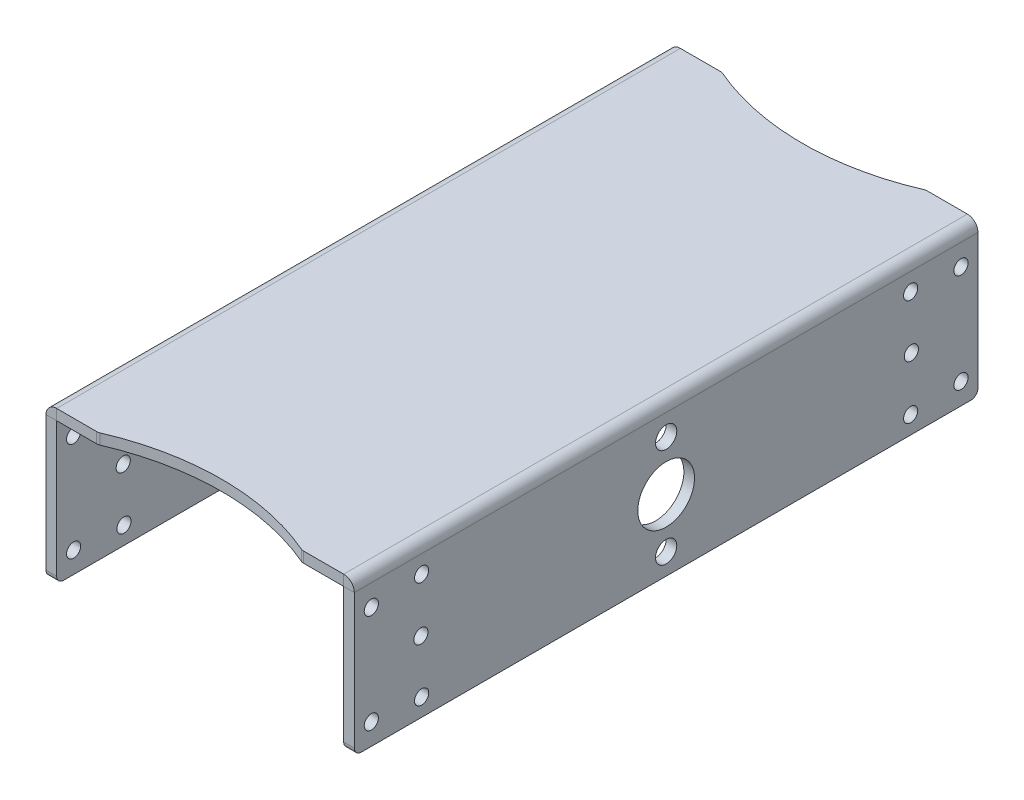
ISO-10303-21;
HEADER;
FILE_DESCRIPTION(('STEP AP214'),'2;1');
FILE_NAME('part.step','',(''),(''),'','','');
FILE_SCHEMA(('AUTOMOTIVE_DESIGN { 1 0 10303 214 1 1 1 1 }'));
ENDSEC;
DATA;
#1=APPLICATION_CONTEXT('core data for automotive mechanical design processes');
#2=APPLICATION_PROTOCOL_DEFINITION('international standard','automotive_design',2000,#1);
#3=PRODUCT_CONTEXT('',#1,'mechanical');
#4=PRODUCT('Part','Part','',(#3));
#5=PRODUCT_RELATED_PRODUCT_CATEGORY('part','',(#4));
#6=PRODUCT_DEFINITION_FORMATION('','',#4);
#7=PRODUCT_DEFINITION_CONTEXT('part definition',#1,'design');
#8=PRODUCT_DEFINITION('design','',#6,#7);
#9=PRODUCT_DEFINITION_SHAPE('','',#8);
#10=(LENGTH_UNIT() NAMED_UNIT(*) SI_UNIT(.MILLI.,.METRE.));
#11=(NAMED_UNIT(*) PLANE_ANGLE_UNIT() SI_UNIT($,.RADIAN.));
#12=(NAMED_UNIT(*) SI_UNIT($,.STERADIAN.) SOLID_ANGLE_UNIT());
#13=UNCERTAINTY_MEASURE_WITH_UNIT(LENGTH_MEASURE(1.E-05),#10,'distance_accuracy_value','');
#14=(GEOMETRIC_REPRESENTATION_CONTEXT(3) GLOBAL_UNCERTAINTY_ASSIGNED_CONTEXT((#13)) GLOBAL_UNIT_ASSIGNED_CONTEXT((#10,
#11,#12)) REPRESENTATION_CONTEXT('',''));
#15=CARTESIAN_POINT('',(0.,0.,0.));
#16=DIRECTION('',(0.,0.,1.));
#17=DIRECTION('',(1.,0.,0.));
#18=AXIS2_PLACEMENT_3D('',#15,#16,#17);
#19=CARTESIAN_POINT('',(-20.25,1.5,-44.));
#20=DIRECTION('',(0.,0.,-1.));
#21=DIRECTION('',(-1.,0.,0.));
#22=AXIS2_PLACEMENT_3D('',#19,#20,#21);
#23=PLANE('',#22);
#24=CARTESIAN_POINT('',(-20.25,0.,-44.));
#25=DIRECTION('',(0.,0.,1.));
#26=DIRECTION('',(1.,0.,0.));
#27=AXIS2_PLACEMENT_3D('',#24,#25,#26);
#28=CIRCLE('',#27,1.5);
#29=CARTESIAN_POINT('',(-20.25,1.5,-44.));
#30=VERTEX_POINT('',#29);
#31=CARTESIAN_POINT('',(-21.75,0.,-44.));
#32=VERTEX_POINT('',#31);
#33=EDGE_CURVE('E409',#30,#32,#28,.T.);
#34=ORIENTED_EDGE('',*,*,#33,.F.);
#35=DIRECTION('',(0.,-1.,0.));
#36=VECTOR('',#35,1.);
#37=CARTESIAN_POINT('',(-20.25,1.5,-44.));
#38=LINE('',#37,#36);
#39=CARTESIAN_POINT('',(-20.25,0.,-44.));
#40=VERTEX_POINT('',#39);
#41=EDGE_CURVE('E386',#30,#40,#38,.T.);
#42=ORIENTED_EDGE('',*,*,#41,.T.);
#43=DIRECTION('',(1.,0.,0.));
#44=VECTOR('',#43,1.);
#45=CARTESIAN_POINT('',(-21.75,0.,-44.));
#46=LINE('',#45,#44);
#47=EDGE_CURVE('E425',#32,#40,#46,.T.);
#48=ORIENTED_EDGE('',*,*,#47,.F.);
#49=EDGE_LOOP('',(#34,#42,#48));
#50=FACE_BOUND('',#49,.T.);
#51=ADVANCED_FACE('F50',(#50),#23,.T.);
#52=CARTESIAN_POINT('',(14.59451951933,1.5,-18.));
#53=DIRECTION('',(0.,-1.,0.));
#54=DIRECTION('',(0.,0.,-1.));
#55=AXIS2_PLACEMENT_3D('',#52,#53,#54);
#56=PLANE('',#55);
#57=DIRECTION('',(1.,0.,0.));
#58=VECTOR('',#57,1.);
#59=CARTESIAN_POINT('',(-20.25,1.5,-44.));
#60=LINE('',#59,#58);
#61=CARTESIAN_POINT('',(-14.59451951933,1.5,-44.));
#62=VERTEX_POINT('',#61);
#63=EDGE_CURVE('E415',#30,#62,#60,.T.);
#64=ORIENTED_EDGE('',*,*,#63,.F.);
#65=DIRECTION('',(0.,0.,-1.));
#66=VECTOR('',#65,1.);
#67=CARTESIAN_POINT('',(-20.25,1.5,19.));
#68=LINE('',#67,#66);
#69=CARTESIAN_POINT('',(-20.25,1.5,44.));
#70=VERTEX_POINT('',#69);
#71=EDGE_CURVE('E12',#70,#30,#68,.T.);
#72=ORIENTED_EDGE('',*,*,#71,.F.);
#73=DIRECTION('',(-1.,0.,0.));
#74=VECTOR('',#73,1.);
#75=CARTESIAN_POINT('',(-14.59451951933,1.5,44.));
#76=LINE('',#75,#74);
#77=CARTESIAN_POINT('',(-14.59451951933,1.5,44.));
#78=VERTEX_POINT('',#77);
#79=EDGE_CURVE('E242',#78,#70,#76,.T.);
#80=ORIENTED_EDGE('',*,*,#79,.F.);
#81=CARTESIAN_POINT('',(-14.59451951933,1.5,42.9999999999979));
#82=DIRECTION('',(0.,-1.,0.));
#83=DIRECTION('',(0.,0.,-1.));
#84=AXIS2_PLACEMENT_3D('',#81,#82,#83);
#85=CIRCLE('',#84,1.00000000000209);
#86=CARTESIAN_POINT('',(-14.2000730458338,1.5,43.9189189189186));
#87=VERTEX_POINT('',#86);
#88=EDGE_CURVE('E590',#87,#78,#85,.T.);
#89=ORIENTED_EDGE('',*,*,#88,.F.);
#90=CARTESIAN_POINT('',(0.,1.5,77.));
#91=DIRECTION('',(0.,1.,0.));
#92=DIRECTION('',(0.,0.,1.));
#93=AXIS2_PLACEMENT_3D('',#90,#91,#92);
#94=CIRCLE('',#93,36.0000000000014);
#95=CARTESIAN_POINT('',(14.200073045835,1.5,43.918918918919));
#96=VERTEX_POINT('',#95);
#97=EDGE_CURVE('E583',#96,#87,#94,.T.);
#98=ORIENTED_EDGE('',*,*,#97,.F.);
#99=CARTESIAN_POINT('',(14.59451951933,1.5,43.));
#100=DIRECTION('',(0.,-1.,0.));
#101=DIRECTION('',(0.,0.,-1.));
#102=AXIS2_PLACEMENT_3D('',#99,#100,#101);
#103=CIRCLE('',#102,0.999999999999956);
#104=CARTESIAN_POINT('',(14.59451951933,1.5,44.));
#105=VERTEX_POINT('',#104);
#106=EDGE_CURVE('E581',#105,#96,#103,.T.);
#107=ORIENTED_EDGE('',*,*,#106,.F.);
#108=DIRECTION('',(-1.,0.,0.));
#109=VECTOR('',#108,1.);
#110=CARTESIAN_POINT('',(20.25,1.5,44.));
#111=LINE('',#110,#109);
#112=CARTESIAN_POINT('',(20.25,1.5,44.));
#113=VERTEX_POINT('',#112);
#114=EDGE_CURVE('E248',#113,#105,#111,.T.);
#115=ORIENTED_EDGE('',*,*,#114,.F.);
#116=DIRECTION('',(0.,0.,1.));
#117=VECTOR('',#116,1.);
#118=CARTESIAN_POINT('',(20.25,1.5,-19.));
#119=LINE('',#118,#117);
#120=CARTESIAN_POINT('',(20.25,1.5,-44.));
#121=VERTEX_POINT('',#120);
#122=EDGE_CURVE('E60',#121,#113,#119,.T.);
#123=ORIENTED_EDGE('',*,*,#122,.F.);
#124=DIRECTION('',(1.,0.,0.));
#125=VECTOR('',#124,1.);
#126=CARTESIAN_POINT('',(14.59451951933,1.5,-44.));
#127=LINE('',#126,#125);
#128=CARTESIAN_POINT('',(14.59451951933,1.5,-44.));
#129=VERTEX_POINT('',#128);
#130=EDGE_CURVE('E418',#129,#121,#127,.T.);
#131=ORIENTED_EDGE('',*,*,#130,.F.);
#132=CARTESIAN_POINT('',(14.59451951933,1.5,-43.));
#133=DIRECTION('',(0.,-1.,0.));
#134=DIRECTION('',(0.,0.,-1.));
#135=AXIS2_PLACEMENT_3D('',#132,#133,#134);
#136=CIRCLE('',#135,0.999999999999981);
#137=CARTESIAN_POINT('',(14.2000730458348,1.5,-43.918918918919));
#138=VERTEX_POINT('',#137);
#139=EDGE_CURVE('E398',#138,#129,#136,.T.);
#140=ORIENTED_EDGE('',*,*,#139,.F.);
#141=CARTESIAN_POINT('',(0.,1.5,-77.));
#142=DIRECTION('',(0.,1.,0.));
#143=DIRECTION('',(0.,0.,1.));
#144=AXIS2_PLACEMENT_3D('',#141,#142,#143);
#145=CIRCLE('',#144,36.0000000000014);
#146=CARTESIAN_POINT('',(-14.2000730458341,1.5,-43.9189189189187));
#147=VERTEX_POINT('',#146);
#148=EDGE_CURVE('E382',#147,#138,#145,.T.);
#149=ORIENTED_EDGE('',*,*,#148,.F.);
#150=CARTESIAN_POINT('',(-14.59451951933,1.5,-43.));
#151=DIRECTION('',(0.,-1.,0.));
#152=DIRECTION('',(0.,0.,-1.));
#153=AXIS2_PLACEMENT_3D('',#150,#151,#152);
#154=CIRCLE('',#153,1.00000000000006);
#155=EDGE_CURVE('E412',#62,#147,#154,.T.);
#156=ORIENTED_EDGE('',*,*,#155,.F.);
#157=EDGE_LOOP('',(#64,#72,#80,#89,#98,#107,#115,#123,#131,#140,#149,#156));
#158=FACE_BOUND('',#157,.T.);
#159=ADVANCED_FACE('F576',(#158),#56,.F.);
#160=CARTESIAN_POINT('',(20.25,1.5,-44.));
#161=DIRECTION('',(0.,0.,1.));
#162=DIRECTION('',(1.,0.,0.));
#163=AXIS2_PLACEMENT_3D('',#160,#161,#162);
#164=PLANE('',#163);
#165=DIRECTION('',(0.,-1.,0.));
#166=VECTOR('',#165,1.);
#167=CARTESIAN_POINT('',(20.25,1.5,-44.));
#168=LINE('',#167,#166);
#169=CARTESIAN_POINT('',(20.25,0.,-44.));
#170=VERTEX_POINT('',#169);
#171=EDGE_CURVE('E383',#121,#170,#168,.T.);
#172=ORIENTED_EDGE('',*,*,#171,.F.);
#173=CARTESIAN_POINT('',(20.25,0.,-44.));
#174=DIRECTION('',(0.,0.,-1.));
#175=DIRECTION('',(-1.,0.,0.));
#176=AXIS2_PLACEMENT_3D('',#173,#174,#175);
#177=CIRCLE('',#176,1.5);
#178=CARTESIAN_POINT('',(21.75,0.,-44.));
#179=VERTEX_POINT('',#178);
#180=EDGE_CURVE('E471',#121,#179,#177,.T.);
#181=ORIENTED_EDGE('',*,*,#180,.T.);
#182=DIRECTION('',(-1.,0.,0.));
#183=VECTOR('',#182,1.);
#184=CARTESIAN_POINT('',(21.75,0.,-44.));
#185=LINE('',#184,#183);
#186=EDGE_CURVE('E480',#179,#170,#185,.T.);
#187=ORIENTED_EDGE('',*,*,#186,.T.);
#188=EDGE_LOOP('',(#172,#181,#187));
#189=FACE_BOUND('',#188,.T.);
#190=ADVANCED_FACE('F691',(#189),#164,.F.);
#191=CARTESIAN_POINT('',(14.59451951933,1.5,-44.));
#192=DIRECTION('',(0.,0.,-1.));
#193=DIRECTION('',(-1.,0.,0.));
#194=AXIS2_PLACEMENT_3D('',#191,#192,#193);
#195=PLANE('',#194);
#196=DIRECTION('',(1.,0.,0.));
#197=VECTOR('',#196,1.);
#198=CARTESIAN_POINT('',(14.59451951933,0.,-44.));
#199=LINE('',#198,#197);
#200=CARTESIAN_POINT('',(14.59451951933,0.,-44.));
#201=VERTEX_POINT('',#200);
#202=EDGE_CURVE('E403',#201,#170,#199,.T.);
#203=ORIENTED_EDGE('',*,*,#202,.F.);
#204=DIRECTION('',(0.,-1.,0.));
#205=VECTOR('',#204,1.);
#206=CARTESIAN_POINT('',(14.59451951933,1.5,-44.));
#207=LINE('',#206,#205);
#208=EDGE_CURVE('E380',#129,#201,#207,.T.);
#209=ORIENTED_EDGE('',*,*,#208,.F.);
#210=ORIENTED_EDGE('',*,*,#130,.T.);
#211=ORIENTED_EDGE('',*,*,#171,.T.);
#212=EDGE_LOOP('',(#203,#209,#210,#211));
#213=FACE_BOUND('',#212,.T.);
#214=ADVANCED_FACE('F693',(#213),#195,.T.);
#215=CARTESIAN_POINT('',(14.59451951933,1.5,-43.));
#216=DIRECTION('',(0.,-1.,0.));
#217=DIRECTION('',(0.,0.,-1.));
#218=AXIS2_PLACEMENT_3D('',#215,#216,#217);
#219=CYLINDRICAL_SURFACE('',#218,0.999999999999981);
#220=CARTESIAN_POINT('',(14.59451951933,0.,-43.));
#221=DIRECTION('',(0.,-1.,0.));
#222=DIRECTION('',(0.,0.,-1.));
#223=AXIS2_PLACEMENT_3D('',#220,#221,#222);
#224=CIRCLE('',#223,0.999999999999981);
#225=CARTESIAN_POINT('',(14.2000730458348,0.,-43.918918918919));
#226=VERTEX_POINT('',#225);
#227=EDGE_CURVE('E406',#226,#201,#224,.T.);
#228=ORIENTED_EDGE('',*,*,#227,.F.);
#229=DIRECTION('',(0.,-1.,0.));
#230=VECTOR('',#229,1.);
#231=CARTESIAN_POINT('',(14.2000730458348,1.5,-43.918918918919));
#232=LINE('',#231,#230);
#233=EDGE_CURVE('E377',#138,#226,#232,.T.);
#234=ORIENTED_EDGE('',*,*,#233,.F.);
#235=ORIENTED_EDGE('',*,*,#139,.T.);
#236=ORIENTED_EDGE('',*,*,#208,.T.);
#237=EDGE_LOOP('',(#228,#234,#235,#236));
#238=FACE_BOUND('',#237,.T.);
#239=ADVANCED_FACE('F798',(#238),#219,.T.);
#240=CARTESIAN_POINT('',(0.,1.5,-77.));
#241=DIRECTION('',(0.,-1.,0.));
#242=DIRECTION('',(0.,0.,-1.));
#243=AXIS2_PLACEMENT_3D('',#240,#241,#242);
#244=CYLINDRICAL_SURFACE('',#243,36.0000000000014);
#245=CARTESIAN_POINT('',(0.,0.,-77.));
#246=DIRECTION('',(0.,1.,0.));
#247=DIRECTION('',(0.,0.,1.));
#248=AXIS2_PLACEMENT_3D('',#245,#246,#247);
#249=CIRCLE('',#248,36.0000000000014);
#250=CARTESIAN_POINT('',(-14.2000730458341,0.,-43.9189189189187));
#251=VERTEX_POINT('',#250);
#252=EDGE_CURVE('E394',#251,#226,#249,.T.);
#253=ORIENTED_EDGE('',*,*,#252,.F.);
#254=DIRECTION('',(0.,-1.,0.));
#255=VECTOR('',#254,1.);
#256=CARTESIAN_POINT('',(-14.2000730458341,1.5,-43.9189189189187));
#257=LINE('',#256,#255);
#258=EDGE_CURVE('E391',#147,#251,#257,.T.);
#259=ORIENTED_EDGE('',*,*,#258,.F.);
#260=ORIENTED_EDGE('',*,*,#148,.T.);
#261=ORIENTED_EDGE('',*,*,#233,.T.);
#262=EDGE_LOOP('',(#253,#259,#260,#261));
#263=FACE_BOUND('',#262,.T.);
#264=ADVANCED_FACE('F801',(#263),#244,.F.);
#265=CARTESIAN_POINT('',(-14.59451951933,1.5,-43.));
#266=DIRECTION('',(0.,-1.,0.));
#267=DIRECTION('',(0.,0.,-1.));
#268=AXIS2_PLACEMENT_3D('',#265,#266,#267);
#269=CYLINDRICAL_SURFACE('',#268,1.00000000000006);
#270=CARTESIAN_POINT('',(-14.59451951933,0.,-43.));
#271=DIRECTION('',(0.,-1.,0.));
#272=DIRECTION('',(0.,0.,-1.));
#273=AXIS2_PLACEMENT_3D('',#270,#271,#272);
#274=CIRCLE('',#273,1.00000000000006);
#275=CARTESIAN_POINT('',(-14.59451951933,0.,-44.));
#276=VERTEX_POINT('',#275);
#277=EDGE_CURVE('E397',#276,#251,#274,.T.);
#278=ORIENTED_EDGE('',*,*,#277,.F.);
#279=DIRECTION('',(0.,-1.,0.));
#280=VECTOR('',#279,1.);
#281=CARTESIAN_POINT('',(-14.59451951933,1.5,-44.));
#282=LINE('',#281,#280);
#283=EDGE_CURVE('E389',#62,#276,#282,.T.);
#284=ORIENTED_EDGE('',*,*,#283,.F.);
#285=ORIENTED_EDGE('',*,*,#155,.T.);
#286=ORIENTED_EDGE('',*,*,#258,.T.);
#287=EDGE_LOOP('',(#278,#284,#285,#286));
#288=FACE_BOUND('',#287,.T.);
#289=ADVANCED_FACE('F808',(#288),#269,.T.);
#290=CARTESIAN_POINT('',(-20.25,1.5,-44.));
#291=DIRECTION('',(0.,0.,-1.));
#292=DIRECTION('',(-1.,0.,0.));
#293=AXIS2_PLACEMENT_3D('',#290,#291,#292);
#294=PLANE('',#293);
#295=DIRECTION('',(1.,0.,0.));
#296=VECTOR('',#295,1.);
#297=CARTESIAN_POINT('',(-20.25,0.,-44.));
#298=LINE('',#297,#296);
#299=EDGE_CURVE('E401',#40,#276,#298,.T.);
#300=ORIENTED_EDGE('',*,*,#299,.F.);
#301=ORIENTED_EDGE('',*,*,#41,.F.);
#302=ORIENTED_EDGE('',*,*,#63,.T.);
#303=ORIENTED_EDGE('',*,*,#283,.T.);
#304=EDGE_LOOP('',(#300,#301,#302,#303));
#305=FACE_BOUND('',#304,.T.);
#306=ADVANCED_FACE('F658',(#305),#294,.T.);
#307=CARTESIAN_POINT('',(20.25,0.,-19.));
#308=DIRECTION('',(0.,0.,-1.));
#309=DIRECTION('',(-1.,0.,0.));
#310=AXIS2_PLACEMENT_3D('',#307,#308,#309);
#311=CYLINDRICAL_SURFACE('',#310,1.5);
#312=ORIENTED_EDGE('',*,*,#122,.T.);
#313=CARTESIAN_POINT('',(20.25,0.,44.));
#314=DIRECTION('',(0.,0.,-1.));
#315=DIRECTION('',(-1.,0.,0.));
#316=AXIS2_PLACEMENT_3D('',#313,#314,#315);
#317=CIRCLE('',#316,1.5);
#318=CARTESIAN_POINT('',(21.75,0.,44.));
#319=VERTEX_POINT('',#318);
#320=EDGE_CURVE('E291',#113,#319,#317,.T.);
#321=ORIENTED_EDGE('',*,*,#320,.T.);
#322=DIRECTION('',(0.,0.,1.));
#323=VECTOR('',#322,1.);
#324=CARTESIAN_POINT('',(21.75,0.,19.));
#325=LINE('',#324,#323);
#326=EDGE_CURVE('E89',#179,#319,#325,.T.);
#327=ORIENTED_EDGE('',*,*,#326,.F.);
#328=ORIENTED_EDGE('',*,*,#180,.F.);
#329=EDGE_LOOP('',(#312,#321,#327,#328));
#330=FACE_BOUND('',#329,.T.);
#331=ADVANCED_FACE('F571',(#330),#311,.T.);
#332=CARTESIAN_POINT('',(21.7500000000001,-17.5,-34.5));
#333=DIRECTION('',(-1.,0.,0.));
#334=DIRECTION('',(0.,-1.,0.));
#335=AXIS2_PLACEMENT_3D('',#332,#333,#334);
#336=CYLINDRICAL_SURFACE('',#335,0.999999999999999);
#337=CARTESIAN_POINT('',(21.7500000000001,-17.5,-34.5));
#338=DIRECTION('',(1.,0.,0.));
#339=DIRECTION('',(0.,-1.,0.));
#340=AXIS2_PLACEMENT_3D('',#337,#338,#339);
#341=CIRCLE('',#340,0.999999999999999);
#342=CARTESIAN_POINT('',(21.7500000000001,-18.5,-34.5));
#343=VERTEX_POINT('',#342);
#344=EDGE_CURVE('E489',#343,#343,#341,.T.);
#345=ORIENTED_EDGE('',*,*,#344,.T.);
#346=EDGE_LOOP('',(#345));
#347=FACE_BOUND('',#346,.T.);
#348=CARTESIAN_POINT('',(20.2500000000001,-17.5,-34.5));
#349=DIRECTION('',(1.,0.,0.));
#350=DIRECTION('',(0.,-1.,0.));
#351=AXIS2_PLACEMENT_3D('',#348,#349,#350);
#352=CIRCLE('',#351,0.999999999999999);
#353=CARTESIAN_POINT('',(20.2500000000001,-18.5,-34.5));
#354=VERTEX_POINT('',#353);
#355=EDGE_CURVE('E492',#354,#354,#352,.T.);
#356=ORIENTED_EDGE('',*,*,#355,.F.);
#357=EDGE_LOOP('',(#356));
#358=FACE_BOUND('',#357,.T.);
#359=ADVANCED_FACE('F657',(#347,#358),#336,.F.);
#360=CARTESIAN_POINT('',(21.7500000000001,-17.,-41.6));
#361=DIRECTION('',(-1.,0.,0.));
#362=DIRECTION('',(0.,-1.,0.));
#363=AXIS2_PLACEMENT_3D('',#360,#361,#362);
#364=CYLINDRICAL_SURFACE('',#363,1.);
#365=CARTESIAN_POINT('',(21.7500000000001,-17.,-41.6));
#366=DIRECTION('',(1.,0.,0.));
#367=DIRECTION('',(0.,-1.,0.));
#368=AXIS2_PLACEMENT_3D('',#365,#366,#367);
#369=CIRCLE('',#368,1.);
#370=CARTESIAN_POINT('',(21.7500000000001,-18.,-41.6));
#371=VERTEX_POINT('',#370);
#372=EDGE_CURVE('E495',#371,#371,#369,.T.);
#373=ORIENTED_EDGE('',*,*,#372,.T.);
#374=EDGE_LOOP('',(#373));
#375=FACE_BOUND('',#374,.T.);
#376=CARTESIAN_POINT('',(20.2500000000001,-17.,-41.6));
#377=DIRECTION('',(1.,0.,0.));
#378=DIRECTION('',(0.,-1.,0.));
#379=AXIS2_PLACEMENT_3D('',#376,#377,#378);
#380=CIRCLE('',#379,1.);
#381=CARTESIAN_POINT('',(20.2500000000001,-18.,-41.6));
#382=VERTEX_POINT('',#381);
#383=EDGE_CURVE('E498',#382,#382,#380,.T.);
#384=ORIENTED_EDGE('',*,*,#383,.F.);
#385=EDGE_LOOP('',(#384));
#386=FACE_BOUND('',#385,.T.);
#387=ADVANCED_FACE('F703',(#375,#386),#364,.F.);
#388=CARTESIAN_POINT('',(21.75,-2.99999999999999,-41.6));
#389=DIRECTION('',(-1.,0.,0.));
#390=DIRECTION('',(0.,-1.,0.));
#391=AXIS2_PLACEMENT_3D('',#388,#389,#390);
#392=CYLINDRICAL_SURFACE('',#391,1.);
#393=CARTESIAN_POINT('',(21.75,-2.99999999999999,-41.6));
#394=DIRECTION('',(1.,0.,0.));
#395=DIRECTION('',(0.,-1.,0.));
#396=AXIS2_PLACEMENT_3D('',#393,#394,#395);
#397=CIRCLE('',#396,1.);
#398=CARTESIAN_POINT('',(21.75,-3.99999999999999,-41.6));
#399=VERTEX_POINT('',#398);
#400=EDGE_CURVE('E501',#399,#399,#397,.T.);
#401=ORIENTED_EDGE('',*,*,#400,.T.);
#402=EDGE_LOOP('',(#401));
#403=FACE_BOUND('',#402,.T.);
#404=CARTESIAN_POINT('',(20.25,-3.,-41.6));
#405=DIRECTION('',(1.,0.,0.));
#406=DIRECTION('',(0.,-1.,0.));
#407=AXIS2_PLACEMENT_3D('',#404,#405,#406);
#408=CIRCLE('',#407,1.);
#409=CARTESIAN_POINT('',(20.25,-4.,-41.6));
#410=VERTEX_POINT('',#409);
#411=EDGE_CURVE('E504',#410,#410,#408,.T.);
#412=ORIENTED_EDGE('',*,*,#411,.F.);
#413=EDGE_LOOP('',(#412));
#414=FACE_BOUND('',#413,.T.);
#415=ADVANCED_FACE('F707',(#403,#414),#392,.F.);
#416=CARTESIAN_POINT('',(21.75,-2.49999999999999,-34.5));
#417=DIRECTION('',(-1.,0.,0.));
#418=DIRECTION('',(0.,-1.,0.));
#419=AXIS2_PLACEMENT_3D('',#416,#417,#418);
#420=CYLINDRICAL_SURFACE('',#419,0.999999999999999);
#421=CARTESIAN_POINT('',(21.75,-2.49999999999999,-34.5));
#422=DIRECTION('',(1.,0.,0.));
#423=DIRECTION('',(0.,-1.,0.));
#424=AXIS2_PLACEMENT_3D('',#421,#422,#423);
#425=CIRCLE('',#424,0.999999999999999);
#426=CARTESIAN_POINT('',(21.75,-3.49999999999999,-34.5));
#427=VERTEX_POINT('',#426);
#428=EDGE_CURVE('E507',#427,#427,#425,.T.);
#429=ORIENTED_EDGE('',*,*,#428,.T.);
#430=EDGE_LOOP('',(#429));
#431=FACE_BOUND('',#430,.T.);
#432=CARTESIAN_POINT('',(20.25,-2.5,-34.5));
#433=DIRECTION('',(1.,0.,0.));
#434=DIRECTION('',(0.,-1.,0.));
#435=AXIS2_PLACEMENT_3D('',#432,#433,#434);
#436=CIRCLE('',#435,0.999999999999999);
#437=CARTESIAN_POINT('',(20.25,-3.5,-34.5));
#438=VERTEX_POINT('',#437);
#439=EDGE_CURVE('E510',#438,#438,#436,.T.);
#440=ORIENTED_EDGE('',*,*,#439,.F.);
#441=EDGE_LOOP('',(#440));
#442=FACE_BOUND('',#441,.T.);
#443=ADVANCED_FACE('F711',(#431,#442),#420,.F.);
#444=CARTESIAN_POINT('',(21.75,-9.99999999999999,-34.6));
#445=DIRECTION('',(-1.,0.,0.));
#446=DIRECTION('',(0.,-1.,0.));
#447=AXIS2_PLACEMENT_3D('',#444,#445,#446);
#448=CYLINDRICAL_SURFACE('',#447,0.999999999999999);
#449=CARTESIAN_POINT('',(21.75,-9.99999999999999,-34.6));
#450=DIRECTION('',(1.,0.,0.));
#451=DIRECTION('',(0.,-1.,0.));
#452=AXIS2_PLACEMENT_3D('',#449,#450,#451);
#453=CIRCLE('',#452,0.999999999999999);
#454=CARTESIAN_POINT('',(21.75,-11.,-34.6));
#455=VERTEX_POINT('',#454);
#456=EDGE_CURVE('E513',#455,#455,#453,.T.);
#457=ORIENTED_EDGE('',*,*,#456,.T.);
#458=EDGE_LOOP('',(#457));
#459=FACE_BOUND('',#458,.T.);
#460=CARTESIAN_POINT('',(20.25,-10.,-34.6));
#461=DIRECTION('',(1.,0.,0.));
#462=DIRECTION('',(0.,-1.,0.));
#463=AXIS2_PLACEMENT_3D('',#460,#461,#462);
#464=CIRCLE('',#463,0.999999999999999);
#465=CARTESIAN_POINT('',(20.25,-11.,-34.6));
#466=VERTEX_POINT('',#465);
#467=EDGE_CURVE('E516',#466,#466,#464,.T.);
#468=ORIENTED_EDGE('',*,*,#467,.F.);
#469=EDGE_LOOP('',(#468));
#470=FACE_BOUND('',#469,.T.);
#471=ADVANCED_FACE('F699',(#459,#470),#448,.F.);
#472=CARTESIAN_POINT('',(21.75,0.,-44.));
#473=DIRECTION('',(0.,0.,1.));
#474=DIRECTION('',(1.,0.,0.));
#475=AXIS2_PLACEMENT_3D('',#472,#473,#474);
#476=PLANE('',#475);
#477=DIRECTION('',(0.,1.,0.));
#478=VECTOR('',#477,1.);
#479=CARTESIAN_POINT('',(20.25,0.,-44.));
#480=LINE('',#479,#478);
#481=CARTESIAN_POINT('',(20.2500000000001,-19.,-44.));
#482=VERTEX_POINT('',#481);
#483=EDGE_CURVE('E484',#482,#170,#480,.T.);
#484=ORIENTED_EDGE('',*,*,#483,.T.);
#485=ORIENTED_EDGE('',*,*,#186,.F.);
#486=DIRECTION('',(0.,1.,0.));
#487=VECTOR('',#486,1.);
#488=CARTESIAN_POINT('',(21.75,0.,-44.));
#489=LINE('',#488,#487);
#490=CARTESIAN_POINT('',(21.7500000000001,-19.,-44.));
#491=VERTEX_POINT('',#490);
#492=EDGE_CURVE('E483',#491,#179,#489,.T.);
#493=ORIENTED_EDGE('',*,*,#492,.F.);
#494=DIRECTION('',(-1.,0.,0.));
#495=VECTOR('',#494,1.);
#496=CARTESIAN_POINT('',(21.7500000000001,-19.,-44.));
#497=LINE('',#496,#495);
#498=EDGE_CURVE('E477',#491,#482,#497,.T.);
#499=ORIENTED_EDGE('',*,*,#498,.T.);
#500=EDGE_LOOP('',(#484,#485,#493,#499));
#501=FACE_BOUND('',#500,.T.);
#502=ADVANCED_FACE('F696',(#501),#476,.F.);
#503=CARTESIAN_POINT('',(14.59451951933,0.,-18.));
#504=DIRECTION('',(0.,-1.,0.));
#505=DIRECTION('',(0.,0.,-1.));
#506=AXIS2_PLACEMENT_3D('',#503,#504,#505);
#507=PLANE('',#506);
#508=DIRECTION('',(0.,0.,1.));
#509=VECTOR('',#508,1.);
#510=CARTESIAN_POINT('',(20.25,0.,-19.));
#511=LINE('',#510,#509);
#512=CARTESIAN_POINT('',(20.25,0.,44.));
#513=VERTEX_POINT('',#512);
#514=EDGE_CURVE('E219',#170,#513,#511,.T.);
#515=ORIENTED_EDGE('',*,*,#514,.T.);
#516=DIRECTION('',(-1.,0.,0.));
#517=VECTOR('',#516,1.);
#518=CARTESIAN_POINT('',(20.25,0.,44.));
#519=LINE('',#518,#517);
#520=CARTESIAN_POINT('',(14.59451951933,0.,44.));
#521=VERTEX_POINT('',#520);
#522=EDGE_CURVE('E534',#513,#521,#519,.T.);
#523=ORIENTED_EDGE('',*,*,#522,.T.);
#524=CARTESIAN_POINT('',(14.59451951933,0.,43.));
#525=DIRECTION('',(0.,-1.,0.));
#526=DIRECTION('',(0.,0.,-1.));
#527=AXIS2_PLACEMENT_3D('',#524,#525,#526);
#528=CIRCLE('',#527,0.999999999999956);
#529=CARTESIAN_POINT('',(14.200073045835,0.,43.918918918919));
#530=VERTEX_POINT('',#529);
#531=EDGE_CURVE('E548',#521,#530,#528,.T.);
#532=ORIENTED_EDGE('',*,*,#531,.T.);
#533=CARTESIAN_POINT('',(0.,0.,77.));
#534=DIRECTION('',(0.,1.,0.));
#535=DIRECTION('',(0.,0.,1.));
#536=AXIS2_PLACEMENT_3D('',#533,#534,#535);
#537=CIRCLE('',#536,36.0000000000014);
#538=CARTESIAN_POINT('',(-14.2000730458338,0.,43.9189189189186));
#539=VERTEX_POINT('',#538);
#540=EDGE_CURVE('E595',#530,#539,#537,.T.);
#541=ORIENTED_EDGE('',*,*,#540,.T.);
#542=CARTESIAN_POINT('',(-14.59451951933,0.,42.9999999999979));
#543=DIRECTION('',(0.,-1.,0.));
#544=DIRECTION('',(0.,0.,-1.));
#545=AXIS2_PLACEMENT_3D('',#542,#543,#544);
#546=CIRCLE('',#545,1.00000000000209);
#547=CARTESIAN_POINT('',(-14.59451951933,0.,44.));
#548=VERTEX_POINT('',#547);
#549=EDGE_CURVE('E247',#539,#548,#546,.T.);
#550=ORIENTED_EDGE('',*,*,#549,.T.);
#551=DIRECTION('',(-1.,0.,0.));
#552=VECTOR('',#551,1.);
#553=CARTESIAN_POINT('',(-14.59451951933,0.,44.));
#554=LINE('',#553,#552);
#555=CARTESIAN_POINT('',(-20.25,0.,44.));
#556=VERTEX_POINT('',#555);
#557=EDGE_CURVE('E239',#548,#556,#554,.T.);
#558=ORIENTED_EDGE('',*,*,#557,.T.);
#559=DIRECTION('',(0.,0.,-1.));
#560=VECTOR('',#559,1.);
#561=CARTESIAN_POINT('',(-20.25,0.,19.));
#562=LINE('',#561,#560);
#563=EDGE_CURVE('E54',#556,#40,#562,.T.);
#564=ORIENTED_EDGE('',*,*,#563,.T.);
#565=ORIENTED_EDGE('',*,*,#299,.T.);
#566=ORIENTED_EDGE('',*,*,#277,.T.);
#567=ORIENTED_EDGE('',*,*,#252,.T.);
#568=ORIENTED_EDGE('',*,*,#227,.T.);
#569=ORIENTED_EDGE('',*,*,#202,.T.);
#570=EDGE_LOOP('',(#515,#523,#532,#541,#550,#558,#564,#565,#566,#567,#568,#569));
#571=FACE_BOUND('',#570,.T.);
#572=ADVANCED_FACE('F52',(#571),#507,.T.);
#573=CARTESIAN_POINT('',(-21.75,-2.49999999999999,-34.5));
#574=DIRECTION('',(1.,0.,0.));
#575=DIRECTION('',(0.,1.,0.));
#576=AXIS2_PLACEMENT_3D('',#573,#574,#575);
#577=CYLINDRICAL_SURFACE('',#576,0.999999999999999);
#578=CARTESIAN_POINT('',(-21.75,-2.49999999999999,-34.5));
#579=DIRECTION('',(-1.,0.,0.));
#580=DIRECTION('',(0.,1.,0.));
#581=AXIS2_PLACEMENT_3D('',#578,#579,#580);
#582=CIRCLE('',#581,0.999999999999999);
#583=CARTESIAN_POINT('',(-21.75,-1.49999999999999,-34.5));
#584=VERTEX_POINT('',#583);
#585=EDGE_CURVE('E459',#584,#584,#582,.T.);
#586=ORIENTED_EDGE('',*,*,#585,.T.);
#587=EDGE_LOOP('',(#586));
#588=FACE_BOUND('',#587,.T.);
#589=CARTESIAN_POINT('',(-20.25,-2.5,-34.5));
#590=DIRECTION('',(-1.,0.,0.));
#591=DIRECTION('',(0.,1.,0.));
#592=AXIS2_PLACEMENT_3D('',#589,#590,#591);
#593=CIRCLE('',#592,0.999999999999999);
#594=CARTESIAN_POINT('',(-20.25,-1.5,-34.5));
#595=VERTEX_POINT('',#594);
#596=EDGE_CURVE('E462',#595,#595,#593,.T.);
#597=ORIENTED_EDGE('',*,*,#596,.F.);
#598=EDGE_LOOP('',(#597));
#599=FACE_BOUND('',#598,.T.);
#600=ADVANCED_FACE('F679',(#588,#599),#577,.F.);
#601=CARTESIAN_POINT('',(-21.7500000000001,-17.,-41.6));
#602=DIRECTION('',(1.,0.,0.));
#603=DIRECTION('',(0.,1.,0.));
#604=AXIS2_PLACEMENT_3D('',#601,#602,#603);
#605=CYLINDRICAL_SURFACE('',#604,1.);
#606=CARTESIAN_POINT('',(-21.7500000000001,-17.,-41.6));
#607=DIRECTION('',(-1.,0.,0.));
#608=DIRECTION('',(0.,1.,0.));
#609=AXIS2_PLACEMENT_3D('',#606,#607,#608);
#610=CIRCLE('',#609,1.);
#611=CARTESIAN_POINT('',(-21.7500000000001,-16.,-41.6));
#612=VERTEX_POINT('',#611);
#613=EDGE_CURVE('E447',#612,#612,#610,.T.);
#614=ORIENTED_EDGE('',*,*,#613,.T.);
#615=EDGE_LOOP('',(#614));
#616=FACE_BOUND('',#615,.T.);
#617=CARTESIAN_POINT('',(-20.2500000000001,-17.,-41.6));
#618=DIRECTION('',(-1.,0.,0.));
#619=DIRECTION('',(0.,1.,0.));
#620=AXIS2_PLACEMENT_3D('',#617,#618,#619);
#621=CIRCLE('',#620,1.);
#622=CARTESIAN_POINT('',(-20.2500000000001,-16.,-41.6));
#623=VERTEX_POINT('',#622);
#624=EDGE_CURVE('E450',#623,#623,#621,.T.);
#625=ORIENTED_EDGE('',*,*,#624,.F.);
#626=EDGE_LOOP('',(#625));
#627=FACE_BOUND('',#626,.T.);
#628=ADVANCED_FACE('F675',(#616,#627),#605,.F.);
#629=CARTESIAN_POINT('',(-21.7500000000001,-17.5,-34.5));
#630=DIRECTION('',(1.,0.,0.));
#631=DIRECTION('',(0.,1.,0.));
#632=AXIS2_PLACEMENT_3D('',#629,#630,#631);
#633=CYLINDRICAL_SURFACE('',#632,0.999999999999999);
#634=CARTESIAN_POINT('',(-21.7500000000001,-17.5,-34.5));
#635=DIRECTION('',(-1.,0.,0.));
#636=DIRECTION('',(0.,1.,0.));
#637=AXIS2_PLACEMENT_3D('',#634,#635,#636);
#638=CIRCLE('',#637,0.999999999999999);
#639=CARTESIAN_POINT('',(-21.7500000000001,-16.5,-34.5));
#640=VERTEX_POINT('',#639);
#641=EDGE_CURVE('E440',#640,#640,#638,.T.);
#642=ORIENTED_EDGE('',*,*,#641,.T.);
#643=EDGE_LOOP('',(#642));
#644=FACE_BOUND('',#643,.T.);
#645=CARTESIAN_POINT('',(-20.2500000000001,-17.5,-34.5));
#646=DIRECTION('',(-1.,0.,0.));
#647=DIRECTION('',(0.,1.,0.));
#648=AXIS2_PLACEMENT_3D('',#645,#646,#647);
#649=CIRCLE('',#648,0.999999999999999);
#650=CARTESIAN_POINT('',(-20.2500000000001,-16.5,-34.5));
#651=VERTEX_POINT('',#650);
#652=EDGE_CURVE('E444',#651,#651,#649,.T.);
#653=ORIENTED_EDGE('',*,*,#652,.F.);
#654=EDGE_LOOP('',(#653));
#655=FACE_BOUND('',#654,.T.);
#656=ADVANCED_FACE('F671',(#644,#655),#633,.F.);
#657=CARTESIAN_POINT('',(-21.75,-2.99999999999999,-41.6));
#658=DIRECTION('',(1.,0.,0.));
#659=DIRECTION('',(0.,1.,0.));
#660=AXIS2_PLACEMENT_3D('',#657,#658,#659);
#661=CYLINDRICAL_SURFACE('',#660,1.);
#662=CARTESIAN_POINT('',(-21.75,-2.99999999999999,-41.6));
#663=DIRECTION('',(-1.,0.,0.));
#664=DIRECTION('',(0.,1.,0.));
#665=AXIS2_PLACEMENT_3D('',#662,#663,#664);
#666=CIRCLE('',#665,1.);
#667=CARTESIAN_POINT('',(-21.75,-1.99999999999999,-41.6));
#668=VERTEX_POINT('',#667);
#669=EDGE_CURVE('E453',#668,#668,#666,.T.);
#670=ORIENTED_EDGE('',*,*,#669,.T.);
#671=EDGE_LOOP('',(#670));
#672=FACE_BOUND('',#671,.T.);
#673=CARTESIAN_POINT('',(-20.25,-3.,-41.6));
#674=DIRECTION('',(-1.,0.,0.));
#675=DIRECTION('',(0.,1.,0.));
#676=AXIS2_PLACEMENT_3D('',#673,#674,#675);
#677=CIRCLE('',#676,1.);
#678=CARTESIAN_POINT('',(-20.25,-2.,-41.6));
#679=VERTEX_POINT('',#678);
#680=EDGE_CURVE('E456',#679,#679,#677,.T.);
#681=ORIENTED_EDGE('',*,*,#680,.F.);
#682=EDGE_LOOP('',(#681));
#683=FACE_BOUND('',#682,.T.);
#684=ADVANCED_FACE('F674',(#672,#683),#661,.F.);
#685=CARTESIAN_POINT('',(-21.75,-9.99999999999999,-34.6));
#686=DIRECTION('',(1.,0.,0.));
#687=DIRECTION('',(0.,1.,0.));
#688=AXIS2_PLACEMENT_3D('',#685,#686,#687);
#689=CYLINDRICAL_SURFACE('',#688,0.999999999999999);
#690=CARTESIAN_POINT('',(-21.75,-9.99999999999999,-34.6));
#691=DIRECTION('',(-1.,0.,0.));
#692=DIRECTION('',(0.,1.,0.));
#693=AXIS2_PLACEMENT_3D('',#690,#691,#692);
#694=CIRCLE('',#693,0.999999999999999);
#695=CARTESIAN_POINT('',(-21.75,-9.,-34.6));
#696=VERTEX_POINT('',#695);
#697=EDGE_CURVE('E465',#696,#696,#694,.T.);
#698=ORIENTED_EDGE('',*,*,#697,.T.);
#699=EDGE_LOOP('',(#698));
#700=FACE_BOUND('',#699,.T.);
#701=CARTESIAN_POINT('',(-20.25,-10.,-34.6));
#702=DIRECTION('',(-1.,0.,0.));
#703=DIRECTION('',(0.,1.,0.));
#704=AXIS2_PLACEMENT_3D('',#701,#702,#703);
#705=CIRCLE('',#704,0.999999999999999);
#706=CARTESIAN_POINT('',(-20.25,-9.,-34.6));
#707=VERTEX_POINT('',#706);
#708=EDGE_CURVE('E468',#707,#707,#705,.T.);
#709=ORIENTED_EDGE('',*,*,#708,.F.);
#710=EDGE_LOOP('',(#709));
#711=FACE_BOUND('',#710,.T.);
#712=ADVANCED_FACE('F683',(#700,#711),#689,.F.);
#713=CARTESIAN_POINT('',(-21.7500000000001,-19.,-44.));
#714=DIRECTION('',(0.,0.,1.));
#715=DIRECTION('',(1.,0.,0.));
#716=AXIS2_PLACEMENT_3D('',#713,#714,#715);
#717=PLANE('',#716);
#718=DIRECTION('',(0.,-1.,0.));
#719=VECTOR('',#718,1.);
#720=CARTESIAN_POINT('',(-20.2500000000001,-19.,-44.));
#721=LINE('',#720,#719);
#722=CARTESIAN_POINT('',(-20.2500000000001,-19.,-44.));
#723=VERTEX_POINT('',#722);
#724=EDGE_CURVE('E214',#40,#723,#721,.T.);
#725=ORIENTED_EDGE('',*,*,#724,.T.);
#726=DIRECTION('',(1.,0.,0.));
#727=VECTOR('',#726,1.);
#728=CARTESIAN_POINT('',(-21.7500000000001,-19.,-44.));
#729=LINE('',#728,#727);
#730=CARTESIAN_POINT('',(-21.7500000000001,-19.,-44.));
#731=VERTEX_POINT('',#730);
#732=EDGE_CURVE('E428',#731,#723,#729,.T.);
#733=ORIENTED_EDGE('',*,*,#732,.F.);
#734=DIRECTION('',(0.,-1.,0.));
#735=VECTOR('',#734,1.);
#736=CARTESIAN_POINT('',(-21.7500000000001,-19.,-44.));
#737=LINE('',#736,#735);
#738=EDGE_CURVE('E438',#32,#731,#737,.T.);
#739=ORIENTED_EDGE('',*,*,#738,.F.);
#740=ORIENTED_EDGE('',*,*,#47,.T.);
#741=EDGE_LOOP('',(#725,#733,#739,#740));
#742=FACE_BOUND('',#741,.T.);
#743=ADVANCED_FACE('F667',(#742),#717,.F.);
#744=CARTESIAN_POINT('',(-20.25,0.,19.));
#745=DIRECTION('',(0.,0.,1.));
#746=DIRECTION('',(1.,0.,0.));
#747=AXIS2_PLACEMENT_3D('',#744,#745,#746);
#748=CYLINDRICAL_SURFACE('',#747,1.5);
#749=ORIENTED_EDGE('',*,*,#33,.T.);
#750=DIRECTION('',(0.,0.,-1.));
#751=VECTOR('',#750,1.);
#752=CARTESIAN_POINT('',(-21.75,0.,-19.));
#753=LINE('',#752,#751);
#754=CARTESIAN_POINT('',(-21.75,0.,44.));
#755=VERTEX_POINT('',#754);
#756=EDGE_CURVE('E526',#755,#32,#753,.T.);
#757=ORIENTED_EDGE('',*,*,#756,.F.);
#758=CARTESIAN_POINT('',(-20.25,0.,44.));
#759=DIRECTION('',(0.,0.,1.));
#760=DIRECTION('',(1.,0.,0.));
#761=AXIS2_PLACEMENT_3D('',#758,#759,#760);
#762=CIRCLE('',#761,1.5);
#763=EDGE_CURVE('E230',#70,#755,#762,.T.);
#764=ORIENTED_EDGE('',*,*,#763,.F.);
#765=ORIENTED_EDGE('',*,*,#71,.T.);
#766=EDGE_LOOP('',(#749,#757,#764,#765));
#767=FACE_BOUND('',#766,.T.);
#768=ADVANCED_FACE('F614',(#767),#748,.T.);
#769=CARTESIAN_POINT('',(-21.7500000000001,-19.,-43.));
#770=DIRECTION('',(1.,0.,0.));
#771=DIRECTION('',(0.,1.,0.));
#772=AXIS2_PLACEMENT_3D('',#769,#770,#771);
#773=CYLINDRICAL_SURFACE('',#772,1.);
#774=CARTESIAN_POINT('',(-20.2500000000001,-19.,-43.));
#775=DIRECTION('',(-1.,0.,0.));
#776=DIRECTION('',(0.,-1.,0.));
#777=AXIS2_PLACEMENT_3D('',#774,#775,#776);
#778=CIRCLE('',#777,1.);
#779=CARTESIAN_POINT('',(-20.2500000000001,-20.,-43.));
#780=VERTEX_POINT('',#779);
#781=EDGE_CURVE('E435',#723,#780,#778,.T.);
#782=ORIENTED_EDGE('',*,*,#781,.T.);
#783=DIRECTION('',(1.,0.,0.));
#784=VECTOR('',#783,1.);
#785=CARTESIAN_POINT('',(-21.7500000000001,-20.,-43.));
#786=LINE('',#785,#784);
#787=CARTESIAN_POINT('',(-21.7500000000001,-20.,-43.));
#788=VERTEX_POINT('',#787);
#789=EDGE_CURVE('E431',#788,#780,#786,.T.);
#790=ORIENTED_EDGE('',*,*,#789,.F.);
#791=CARTESIAN_POINT('',(-21.7500000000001,-19.,-43.));
#792=DIRECTION('',(-1.,0.,0.));
#793=DIRECTION('',(0.,-1.,0.));
#794=AXIS2_PLACEMENT_3D('',#791,#792,#793);
#795=CIRCLE('',#794,1.);
#796=EDGE_CURVE('E434',#731,#788,#795,.T.);
#797=ORIENTED_EDGE('',*,*,#796,.F.);
#798=ORIENTED_EDGE('',*,*,#732,.T.);
#799=EDGE_LOOP('',(#782,#790,#797,#798));
#800=FACE_BOUND('',#799,.T.);
#801=ADVANCED_FACE('F629',(#800),#773,.T.);
#802=CARTESIAN_POINT('',(-21.7500000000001,-19.,18.));
#803=DIRECTION('',(-1.,0.,0.));
#804=DIRECTION('',(0.,-1.,0.));
#805=AXIS2_PLACEMENT_3D('',#802,#803,#804);
#806=PLANE('',#805);
#807=DIRECTION('',(0.,0.,1.));
#808=VECTOR('',#807,1.);
#809=CARTESIAN_POINT('',(-21.7500000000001,-20.,18.));
#810=LINE('',#809,#808);
#811=CARTESIAN_POINT('',(-21.7500000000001,-20.,43.));
#812=VERTEX_POINT('',#811);
#813=EDGE_CURVE('E528',#788,#812,#810,.T.);
#814=ORIENTED_EDGE('',*,*,#813,.T.);
#815=CARTESIAN_POINT('',(-21.7500000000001,-19.,43.));
#816=DIRECTION('',(-1.,0.,0.));
#817=DIRECTION('',(0.,-1.,0.));
#818=AXIS2_PLACEMENT_3D('',#815,#816,#817);
#819=CIRCLE('',#818,1.);
#820=CARTESIAN_POINT('',(-21.7500000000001,-19.,44.));
#821=VERTEX_POINT('',#820);
#822=EDGE_CURVE('E254',#812,#821,#819,.T.);
#823=ORIENTED_EDGE('',*,*,#822,.T.);
#824=DIRECTION('',(0.,1.,0.));
#825=VECTOR('',#824,1.);
#826=CARTESIAN_POINT('',(-21.75,0.,44.));
#827=LINE('',#826,#825);
#828=EDGE_CURVE('E259',#821,#755,#827,.T.);
#829=ORIENTED_EDGE('',*,*,#828,.T.);
#830=ORIENTED_EDGE('',*,*,#756,.T.);
#831=ORIENTED_EDGE('',*,*,#738,.T.);
#832=ORIENTED_EDGE('',*,*,#796,.T.);
#833=EDGE_LOOP('',(#814,#823,#829,#830,#831,#832));
#834=FACE_BOUND('',#833,.T.);
#835=ORIENTED_EDGE('',*,*,#697,.F.);
#836=EDGE_LOOP('',(#835));
#837=FACE_BOUND('',#836,.T.);
#838=ORIENTED_EDGE('',*,*,#669,.F.);
#839=EDGE_LOOP('',(#838));
#840=FACE_BOUND('',#839,.T.);
#841=ORIENTED_EDGE('',*,*,#641,.F.);
#842=EDGE_LOOP('',(#841));
#843=FACE_BOUND('',#842,.T.);
#844=ORIENTED_EDGE('',*,*,#613,.F.);
#845=EDGE_LOOP('',(#844));
#846=FACE_BOUND('',#845,.T.);
#847=ORIENTED_EDGE('',*,*,#585,.F.);
#848=EDGE_LOOP('',(#847));
#849=FACE_BOUND('',#848,.T.);
#850=CARTESIAN_POINT('',(-21.75,-9.99999999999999,0.));
#851=DIRECTION('',(-1.,0.,0.));
#852=DIRECTION('',(0.,1.,0.));
#853=AXIS2_PLACEMENT_3D('',#850,#851,#852);
#854=CIRCLE('',#853,4.);
#855=CARTESIAN_POINT('',(-21.75,-5.99999999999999,0.));
#856=VERTEX_POINT('',#855);
#857=EDGE_CURVE('E362',#856,#856,#854,.T.);
#858=ORIENTED_EDGE('',*,*,#857,.F.);
#859=EDGE_LOOP('',(#858));
#860=FACE_BOUND('',#859,.T.);
#861=CARTESIAN_POINT('',(-21.75,-2.99999999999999,0.));
#862=DIRECTION('',(-1.,0.,0.));
#863=DIRECTION('',(0.,1.,0.));
#864=AXIS2_PLACEMENT_3D('',#861,#862,#863);
#865=CIRCLE('',#864,1.5);
#866=CARTESIAN_POINT('',(-21.75,-1.49999999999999,0.));
#867=VERTEX_POINT('',#866);
#868=EDGE_CURVE('E368',#867,#867,#865,.T.);
#869=ORIENTED_EDGE('',*,*,#868,.F.);
#870=EDGE_LOOP('',(#869));
#871=FACE_BOUND('',#870,.T.);
#872=CARTESIAN_POINT('',(-21.7500000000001,-17.,0.));
#873=DIRECTION('',(-1.,0.,0.));
#874=DIRECTION('',(0.,1.,0.));
#875=AXIS2_PLACEMENT_3D('',#872,#873,#874);
#876=CIRCLE('',#875,1.5);
#877=CARTESIAN_POINT('',(-21.7500000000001,-15.5,0.));
#878=VERTEX_POINT('',#877);
#879=EDGE_CURVE('E374',#878,#878,#876,.T.);
#880=ORIENTED_EDGE('',*,*,#879,.F.);
#881=EDGE_LOOP('',(#880));
#882=FACE_BOUND('',#881,.T.);
#883=CARTESIAN_POINT('',(-21.75,-2.99999999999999,41.6));
#884=DIRECTION('',(-1.,0.,0.));
#885=DIRECTION('',(0.,1.,0.));
#886=AXIS2_PLACEMENT_3D('',#883,#884,#885);
#887=CIRCLE('',#886,1.);
#888=CARTESIAN_POINT('',(-21.75,-1.99999999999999,41.6));
#889=VERTEX_POINT('',#888);
#890=EDGE_CURVE('E285',#889,#889,#887,.T.);
#891=ORIENTED_EDGE('',*,*,#890,.F.);
#892=EDGE_LOOP('',(#891));
#893=FACE_BOUND('',#892,.T.);
#894=CARTESIAN_POINT('',(-21.7500000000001,-17.5,34.5));
#895=DIRECTION('',(-1.,0.,0.));
#896=DIRECTION('',(0.,1.,0.));
#897=AXIS2_PLACEMENT_3D('',#894,#895,#896);
#898=CIRCLE('',#897,0.999999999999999);
#899=CARTESIAN_POINT('',(-21.7500000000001,-16.5,34.5));
#900=VERTEX_POINT('',#899);
#901=EDGE_CURVE('E273',#900,#900,#898,.T.);
#902=ORIENTED_EDGE('',*,*,#901,.F.);
#903=EDGE_LOOP('',(#902));
#904=FACE_BOUND('',#903,.T.);
#905=CARTESIAN_POINT('',(-21.75,-2.49999999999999,34.5));
#906=DIRECTION('',(-1.,0.,0.));
#907=DIRECTION('',(0.,1.,0.));
#908=AXIS2_PLACEMENT_3D('',#905,#906,#907);
#909=CIRCLE('',#908,0.999999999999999);
#910=CARTESIAN_POINT('',(-21.75,-1.49999999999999,34.5));
#911=VERTEX_POINT('',#910);
#912=EDGE_CURVE('E256',#911,#911,#909,.T.);
#913=ORIENTED_EDGE('',*,*,#912,.F.);
#914=EDGE_LOOP('',(#913));
#915=FACE_BOUND('',#914,.T.);
#916=CARTESIAN_POINT('',(-21.75,-9.99999999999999,34.6));
#917=DIRECTION('',(-1.,0.,0.));
#918=DIRECTION('',(0.,1.,0.));
#919=AXIS2_PLACEMENT_3D('',#916,#917,#918);
#920=CIRCLE('',#919,0.999999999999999);
#921=CARTESIAN_POINT('',(-21.75,-9.,34.6));
#922=VERTEX_POINT('',#921);
#923=EDGE_CURVE('E267',#922,#922,#920,.T.);
#924=ORIENTED_EDGE('',*,*,#923,.F.);
#925=EDGE_LOOP('',(#924));
#926=FACE_BOUND('',#925,.T.);
#927=CARTESIAN_POINT('',(-21.7500000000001,-17.,41.6));
#928=DIRECTION('',(-1.,0.,0.));
#929=DIRECTION('',(0.,1.,0.));
#930=AXIS2_PLACEMENT_3D('',#927,#928,#929);
#931=CIRCLE('',#930,1.);
#932=CARTESIAN_POINT('',(-21.7500000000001,-16.,41.6));
#933=VERTEX_POINT('',#932);
#934=EDGE_CURVE('E279',#933,#933,#931,.T.);
#935=ORIENTED_EDGE('',*,*,#934,.F.);
#936=EDGE_LOOP('',(#935));
#937=FACE_BOUND('',#936,.T.);
#938=ADVANCED_FACE('F617',(#834,#837,#840,#843,#846,#849,#860,#871,#882,#893,#904,#915,#926,
#937),#806,.T.);
#939=CARTESIAN_POINT('',(-20.2500000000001,-19.,18.));
#940=DIRECTION('',(-1.,0.,0.));
#941=DIRECTION('',(0.,-1.,0.));
#942=AXIS2_PLACEMENT_3D('',#939,#940,#941);
#943=PLANE('',#942);
#944=ORIENTED_EDGE('',*,*,#724,.F.);
#945=ORIENTED_EDGE('',*,*,#563,.F.);
#946=DIRECTION('',(0.,1.,0.));
#947=VECTOR('',#946,1.);
#948=CARTESIAN_POINT('',(-20.25,0.,44.));
#949=LINE('',#948,#947);
#950=CARTESIAN_POINT('',(-20.2500000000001,-19.,44.));
#951=VERTEX_POINT('',#950);
#952=EDGE_CURVE('E211',#951,#556,#949,.T.);
#953=ORIENTED_EDGE('',*,*,#952,.F.);
#954=CARTESIAN_POINT('',(-20.2500000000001,-19.,43.));
#955=DIRECTION('',(-1.,0.,0.));
#956=DIRECTION('',(0.,-1.,0.));
#957=AXIS2_PLACEMENT_3D('',#954,#955,#956);
#958=CIRCLE('',#957,1.);
#959=CARTESIAN_POINT('',(-20.2500000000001,-20.,43.));
#960=VERTEX_POINT('',#959);
#961=EDGE_CURVE('E253',#960,#951,#958,.T.);
#962=ORIENTED_EDGE('',*,*,#961,.F.);
#963=DIRECTION('',(0.,0.,1.));
#964=VECTOR('',#963,1.);
#965=CARTESIAN_POINT('',(-20.2500000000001,-20.,18.));
#966=LINE('',#965,#964);
#967=EDGE_CURVE('E524',#780,#960,#966,.T.);
#968=ORIENTED_EDGE('',*,*,#967,.F.);
#969=ORIENTED_EDGE('',*,*,#781,.F.);
#970=EDGE_LOOP('',(#944,#945,#953,#962,#968,#969));
#971=FACE_BOUND('',#970,.T.);
#972=ORIENTED_EDGE('',*,*,#708,.T.);
#973=EDGE_LOOP('',(#972));
#974=FACE_BOUND('',#973,.T.);
#975=ORIENTED_EDGE('',*,*,#596,.T.);
#976=EDGE_LOOP('',(#975));
#977=FACE_BOUND('',#976,.T.);
#978=ORIENTED_EDGE('',*,*,#680,.T.);
#979=EDGE_LOOP('',(#978));
#980=FACE_BOUND('',#979,.T.);
#981=ORIENTED_EDGE('',*,*,#624,.T.);
#982=EDGE_LOOP('',(#981));
#983=FACE_BOUND('',#982,.T.);
#984=ORIENTED_EDGE('',*,*,#652,.T.);
#985=EDGE_LOOP('',(#984));
#986=FACE_BOUND('',#985,.T.);
#987=CARTESIAN_POINT('',(-20.2500000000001,-17.,0.));
#988=DIRECTION('',(-1.,0.,0.));
#989=DIRECTION('',(0.,1.,0.));
#990=AXIS2_PLACEMENT_3D('',#987,#988,#989);
#991=CIRCLE('',#990,1.5);
#992=CARTESIAN_POINT('',(-20.2500000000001,-15.5,0.));
#993=VERTEX_POINT('',#992);
#994=EDGE_CURVE('E371',#993,#993,#991,.T.);
#995=ORIENTED_EDGE('',*,*,#994,.T.);
#996=EDGE_LOOP('',(#995));
#997=FACE_BOUND('',#996,.T.);
#998=CARTESIAN_POINT('',(-20.25,-3.,0.));
#999=DIRECTION('',(-1.,0.,0.));
#1000=DIRECTION('',(0.,1.,0.));
#1001=AXIS2_PLACEMENT_3D('',#998,#999,#1000);
#1002=CIRCLE('',#1001,1.5);
#1003=CARTESIAN_POINT('',(-20.25,-1.5,0.));
#1004=VERTEX_POINT('',#1003);
#1005=EDGE_CURVE('E365',#1004,#1004,#1002,.T.);
#1006=ORIENTED_EDGE('',*,*,#1005,.T.);
#1007=EDGE_LOOP('',(#1006));
#1008=FACE_BOUND('',#1007,.T.);
#1009=CARTESIAN_POINT('',(-20.25,-10.,0.));
#1010=DIRECTION('',(-1.,0.,0.));
#1011=DIRECTION('',(0.,1.,0.));
#1012=AXIS2_PLACEMENT_3D('',#1009,#1010,#1011);
#1013=CIRCLE('',#1012,4.);
#1014=CARTESIAN_POINT('',(-20.25,-6.,0.));
#1015=VERTEX_POINT('',#1014);
#1016=EDGE_CURVE('E359',#1015,#1015,#1013,.T.);
#1017=ORIENTED_EDGE('',*,*,#1016,.T.);
#1018=EDGE_LOOP('',(#1017));
#1019=FACE_BOUND('',#1018,.T.);
#1020=CARTESIAN_POINT('',(-20.25,-3.,41.6));
#1021=DIRECTION('',(-1.,0.,0.));
#1022=DIRECTION('',(0.,1.,0.));
#1023=AXIS2_PLACEMENT_3D('',#1020,#1021,#1022);
#1024=CIRCLE('',#1023,1.);
#1025=CARTESIAN_POINT('',(-20.25,-2.,41.6));
#1026=VERTEX_POINT('',#1025);
#1027=EDGE_CURVE('E288',#1026,#1026,#1024,.T.);
#1028=ORIENTED_EDGE('',*,*,#1027,.T.);
#1029=EDGE_LOOP('',(#1028));
#1030=FACE_BOUND('',#1029,.T.);
#1031=CARTESIAN_POINT('',(-20.2500000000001,-17.,41.6));
#1032=DIRECTION('',(-1.,0.,0.));
#1033=DIRECTION('',(0.,1.,0.));
#1034=AXIS2_PLACEMENT_3D('',#1031,#1032,#1033);
#1035=CIRCLE('',#1034,1.);
#1036=CARTESIAN_POINT('',(-20.2500000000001,-16.,41.6));
#1037=VERTEX_POINT('',#1036);
#1038=EDGE_CURVE('E282',#1037,#1037,#1035,.T.);
#1039=ORIENTED_EDGE('',*,*,#1038,.T.);
#1040=EDGE_LOOP('',(#1039));
#1041=FACE_BOUND('',#1040,.T.);
#1042=CARTESIAN_POINT('',(-20.2500000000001,-17.5,34.5));
#1043=DIRECTION('',(-1.,0.,0.));
#1044=DIRECTION('',(0.,1.,0.));
#1045=AXIS2_PLACEMENT_3D('',#1042,#1043,#1044);
#1046=CIRCLE('',#1045,0.999999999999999);
#1047=CARTESIAN_POINT('',(-20.2500000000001,-16.5,34.5));
#1048=VERTEX_POINT('',#1047);
#1049=EDGE_CURVE('E276',#1048,#1048,#1046,.T.);
#1050=ORIENTED_EDGE('',*,*,#1049,.T.);
#1051=EDGE_LOOP('',(#1050));
#1052=FACE_BOUND('',#1051,.T.);
#1053=CARTESIAN_POINT('',(-20.25,-10.,34.6));
#1054=DIRECTION('',(-1.,0.,0.));
#1055=DIRECTION('',(0.,1.,0.));
#1056=AXIS2_PLACEMENT_3D('',#1053,#1054,#1055);
#1057=CIRCLE('',#1056,0.999999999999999);
#1058=CARTESIAN_POINT('',(-20.25,-9.,34.6));
#1059=VERTEX_POINT('',#1058);
#1060=EDGE_CURVE('E270',#1059,#1059,#1057,.T.);
#1061=ORIENTED_EDGE('',*,*,#1060,.T.);
#1062=EDGE_LOOP('',(#1061));
#1063=FACE_BOUND('',#1062,.T.);
#1064=CARTESIAN_POINT('',(-20.25,-2.5,34.5));
#1065=DIRECTION('',(-1.,0.,0.));
#1066=DIRECTION('',(0.,1.,0.));
#1067=AXIS2_PLACEMENT_3D('',#1064,#1065,#1066);
#1068=CIRCLE('',#1067,0.999999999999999);
#1069=CARTESIAN_POINT('',(-20.25,-1.5,34.5));
#1070=VERTEX_POINT('',#1069);
#1071=EDGE_CURVE('E264',#1070,#1070,#1068,.T.);
#1072=ORIENTED_EDGE('',*,*,#1071,.T.);
#1073=EDGE_LOOP('',(#1072));
#1074=FACE_BOUND('',#1073,.T.);
#1075=ADVANCED_FACE('F207',(#971,#974,#977,#980,#983,#986,#997,#1008,#1019,#1030,#1041,#1052,
#1063,#1074),#943,.F.);
#1076=CARTESIAN_POINT('',(-21.7500000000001,-20.,18.));
#1077=DIRECTION('',(0.,1.,0.));
#1078=DIRECTION('',(-1.,0.,0.));
#1079=AXIS2_PLACEMENT_3D('',#1076,#1077,#1078);
#1080=PLANE('',#1079);
#1081=ORIENTED_EDGE('',*,*,#967,.T.);
#1082=DIRECTION('',(1.,0.,0.));
#1083=VECTOR('',#1082,1.);
#1084=CARTESIAN_POINT('',(-21.7500000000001,-20.,43.));
#1085=LINE('',#1084,#1083);
#1086=EDGE_CURVE('E233',#812,#960,#1085,.T.);
#1087=ORIENTED_EDGE('',*,*,#1086,.F.);
#1088=ORIENTED_EDGE('',*,*,#813,.F.);
#1089=ORIENTED_EDGE('',*,*,#789,.T.);
#1090=EDGE_LOOP('',(#1081,#1087,#1088,#1089));
#1091=FACE_BOUND('',#1090,.T.);
#1092=ADVANCED_FACE('F631',(#1091),#1080,.F.);
#1093=CARTESIAN_POINT('',(21.7500000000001,-19.,-43.));
#1094=DIRECTION('',(-1.,0.,0.));
#1095=DIRECTION('',(0.,-1.,0.));
#1096=AXIS2_PLACEMENT_3D('',#1093,#1094,#1095);
#1097=CYLINDRICAL_SURFACE('',#1096,1.);
#1098=CARTESIAN_POINT('',(20.2500000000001,-19.,-43.));
#1099=DIRECTION('',(1.,0.,0.));
#1100=DIRECTION('',(0.,1.,0.));
#1101=AXIS2_PLACEMENT_3D('',#1098,#1099,#1100);
#1102=CIRCLE('',#1101,1.);
#1103=CARTESIAN_POINT('',(20.2500000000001,-20.,-43.));
#1104=VERTEX_POINT('',#1103);
#1105=EDGE_CURVE('E487',#1104,#482,#1102,.T.);
#1106=ORIENTED_EDGE('',*,*,#1105,.T.);
#1107=ORIENTED_EDGE('',*,*,#498,.F.);
#1108=CARTESIAN_POINT('',(21.7500000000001,-19.,-43.));
#1109=DIRECTION('',(1.,0.,0.));
#1110=DIRECTION('',(0.,1.,0.));
#1111=AXIS2_PLACEMENT_3D('',#1108,#1109,#1110);
#1112=CIRCLE('',#1111,1.);
#1113=CARTESIAN_POINT('',(21.7500000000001,-20.,-43.));
#1114=VERTEX_POINT('',#1113);
#1115=EDGE_CURVE('E81',#1114,#491,#1112,.T.);
#1116=ORIENTED_EDGE('',*,*,#1115,.F.);
#1117=DIRECTION('',(-1.,0.,0.));
#1118=VECTOR('',#1117,1.);
#1119=CARTESIAN_POINT('',(21.7500000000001,-20.,-43.));
#1120=LINE('',#1119,#1118);
#1121=EDGE_CURVE('E475',#1114,#1104,#1120,.T.);
#1122=ORIENTED_EDGE('',*,*,#1121,.T.);
#1123=EDGE_LOOP('',(#1106,#1107,#1116,#1122));
#1124=FACE_BOUND('',#1123,.T.);
#1125=ADVANCED_FACE('F633',(#1124),#1097,.T.);
#1126=CARTESIAN_POINT('',(20.2500000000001,-19.,18.));
#1127=DIRECTION('',(1.,0.,0.));
#1128=DIRECTION('',(0.,1.,0.));
#1129=AXIS2_PLACEMENT_3D('',#1126,#1127,#1128);
#1130=PLANE('',#1129);
#1131=ORIENTED_EDGE('',*,*,#1105,.F.);
#1132=DIRECTION('',(0.,0.,-1.));
#1133=VECTOR('',#1132,1.);
#1134=CARTESIAN_POINT('',(20.2500000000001,-20.,-18.));
#1135=LINE('',#1134,#1133);
#1136=CARTESIAN_POINT('',(20.2500000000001,-20.,43.));
#1137=VERTEX_POINT('',#1136);
#1138=EDGE_CURVE('E69',#1137,#1104,#1135,.T.);
#1139=ORIENTED_EDGE('',*,*,#1138,.F.);
#1140=CARTESIAN_POINT('',(20.2500000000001,-19.,43.));
#1141=DIRECTION('',(1.,0.,0.));
#1142=DIRECTION('',(0.,1.,0.));
#1143=AXIS2_PLACEMENT_3D('',#1140,#1141,#1142);
#1144=CIRCLE('',#1143,1.);
#1145=CARTESIAN_POINT('',(20.2500000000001,-19.,44.));
#1146=VERTEX_POINT('',#1145);
#1147=EDGE_CURVE('E306',#1146,#1137,#1144,.T.);
#1148=ORIENTED_EDGE('',*,*,#1147,.F.);
#1149=DIRECTION('',(0.,-1.,0.));
#1150=VECTOR('',#1149,1.);
#1151=CARTESIAN_POINT('',(20.2500000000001,-19.,44.));
#1152=LINE('',#1151,#1150);
#1153=EDGE_CURVE('E304',#513,#1146,#1152,.T.);
#1154=ORIENTED_EDGE('',*,*,#1153,.F.);
#1155=ORIENTED_EDGE('',*,*,#514,.F.);
#1156=ORIENTED_EDGE('',*,*,#483,.F.);
#1157=EDGE_LOOP('',(#1131,#1139,#1148,#1154,#1155,#1156));
#1158=FACE_BOUND('',#1157,.T.);
#1159=ORIENTED_EDGE('',*,*,#467,.T.);
#1160=EDGE_LOOP('',(#1159));
#1161=FACE_BOUND('',#1160,.T.);
#1162=ORIENTED_EDGE('',*,*,#439,.T.);
#1163=EDGE_LOOP('',(#1162));
#1164=FACE_BOUND('',#1163,.T.);
#1165=ORIENTED_EDGE('',*,*,#411,.T.);
#1166=EDGE_LOOP('',(#1165));
#1167=FACE_BOUND('',#1166,.T.);
#1168=ORIENTED_EDGE('',*,*,#383,.T.);
#1169=EDGE_LOOP('',(#1168));
#1170=FACE_BOUND('',#1169,.T.);
#1171=ORIENTED_EDGE('',*,*,#355,.T.);
#1172=EDGE_LOOP('',(#1171));
#1173=FACE_BOUND('',#1172,.T.);
#1174=CARTESIAN_POINT('',(20.2500000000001,-17.,0.));
#1175=DIRECTION('',(1.,0.,0.));
#1176=DIRECTION('',(0.,-1.,0.));
#1177=AXIS2_PLACEMENT_3D('',#1174,#1175,#1176);
#1178=CIRCLE('',#1177,1.5);
#1179=CARTESIAN_POINT('',(20.2500000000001,-18.5,0.));
#1180=VERTEX_POINT('',#1179);
#1181=EDGE_CURVE('E353',#1180,#1180,#1178,.T.);
#1182=ORIENTED_EDGE('',*,*,#1181,.T.);
#1183=EDGE_LOOP('',(#1182));
#1184=FACE_BOUND('',#1183,.T.);
#1185=CARTESIAN_POINT('',(20.25,-3.,0.));
#1186=DIRECTION('',(1.,0.,0.));
#1187=DIRECTION('',(0.,-1.,0.));
#1188=AXIS2_PLACEMENT_3D('',#1185,#1186,#1187);
#1189=CIRCLE('',#1188,1.5);
#1190=CARTESIAN_POINT('',(20.25,-4.5,0.));
#1191=VERTEX_POINT('',#1190);
#1192=EDGE_CURVE('E347',#1191,#1191,#1189,.T.);
#1193=ORIENTED_EDGE('',*,*,#1192,.T.);
#1194=EDGE_LOOP('',(#1193));
#1195=FACE_BOUND('',#1194,.T.);
#1196=CARTESIAN_POINT('',(20.25,-10.,0.));
#1197=DIRECTION('',(1.,0.,0.));
#1198=DIRECTION('',(0.,-1.,0.));
#1199=AXIS2_PLACEMENT_3D('',#1196,#1197,#1198);
#1200=CIRCLE('',#1199,4.);
#1201=CARTESIAN_POINT('',(20.2500000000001,-14.,0.));
#1202=VERTEX_POINT('',#1201);
#1203=EDGE_CURVE('E341',#1202,#1202,#1200,.T.);
#1204=ORIENTED_EDGE('',*,*,#1203,.T.);
#1205=EDGE_LOOP('',(#1204));
#1206=FACE_BOUND('',#1205,.T.);
#1207=CARTESIAN_POINT('',(20.25,-3.,41.6));
#1208=DIRECTION('',(1.,0.,0.));
#1209=DIRECTION('',(0.,-1.,0.));
#1210=AXIS2_PLACEMENT_3D('',#1207,#1208,#1209);
#1211=CIRCLE('',#1210,1.);
#1212=CARTESIAN_POINT('',(20.25,-4.,41.6));
#1213=VERTEX_POINT('',#1212);
#1214=EDGE_CURVE('E338',#1213,#1213,#1211,.T.);
#1215=ORIENTED_EDGE('',*,*,#1214,.T.);
#1216=EDGE_LOOP('',(#1215));
#1217=FACE_BOUND('',#1216,.T.);
#1218=CARTESIAN_POINT('',(20.2500000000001,-17.,41.6));
#1219=DIRECTION('',(1.,0.,0.));
#1220=DIRECTION('',(0.,-1.,0.));
#1221=AXIS2_PLACEMENT_3D('',#1218,#1219,#1220);
#1222=CIRCLE('',#1221,1.);
#1223=CARTESIAN_POINT('',(20.2500000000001,-18.,41.6));
#1224=VERTEX_POINT('',#1223);
#1225=EDGE_CURVE('E332',#1224,#1224,#1222,.T.);
#1226=ORIENTED_EDGE('',*,*,#1225,.T.);
#1227=EDGE_LOOP('',(#1226));
#1228=FACE_BOUND('',#1227,.T.);
#1229=CARTESIAN_POINT('',(20.2500000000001,-17.5,34.5));
#1230=DIRECTION('',(1.,0.,0.));
#1231=DIRECTION('',(0.,-1.,0.));
#1232=AXIS2_PLACEMENT_3D('',#1229,#1230,#1231);
#1233=CIRCLE('',#1232,0.999999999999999);
#1234=CARTESIAN_POINT('',(20.2500000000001,-18.5,34.5));
#1235=VERTEX_POINT('',#1234);
#1236=EDGE_CURVE('E326',#1235,#1235,#1233,.T.);
#1237=ORIENTED_EDGE('',*,*,#1236,.T.);
#1238=EDGE_LOOP('',(#1237));
#1239=FACE_BOUND('',#1238,.T.);
#1240=CARTESIAN_POINT('',(20.25,-10.,34.6));
#1241=DIRECTION('',(1.,0.,0.));
#1242=DIRECTION('',(0.,-1.,0.));
#1243=AXIS2_PLACEMENT_3D('',#1240,#1241,#1242);
#1244=CIRCLE('',#1243,0.999999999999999);
#1245=CARTESIAN_POINT('',(20.25,-11.,34.6));
#1246=VERTEX_POINT('',#1245);
#1247=EDGE_CURVE('E320',#1246,#1246,#1244,.T.);
#1248=ORIENTED_EDGE('',*,*,#1247,.T.);
#1249=EDGE_LOOP('',(#1248));
#1250=FACE_BOUND('',#1249,.T.);
#1251=CARTESIAN_POINT('',(20.25,-2.5,34.5));
#1252=DIRECTION('',(1.,0.,0.));
#1253=DIRECTION('',(0.,-1.,0.));
#1254=AXIS2_PLACEMENT_3D('',#1251,#1252,#1253);
#1255=CIRCLE('',#1254,0.999999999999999);
#1256=CARTESIAN_POINT('',(20.25,-3.5,34.5));
#1257=VERTEX_POINT('',#1256);
#1258=EDGE_CURVE('E314',#1257,#1257,#1255,.T.);
#1259=ORIENTED_EDGE('',*,*,#1258,.T.);
#1260=EDGE_LOOP('',(#1259));
#1261=FACE_BOUND('',#1260,.T.);
#1262=ADVANCED_FACE('F561',(#1158,#1161,#1164,#1167,#1170,#1173,#1184,#1195,#1206,#1217,#1228,
#1239,#1250,#1261),#1130,.F.);
#1263=CARTESIAN_POINT('',(21.7500000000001,-19.,18.));
#1264=DIRECTION('',(1.,0.,0.));
#1265=DIRECTION('',(0.,1.,0.));
#1266=AXIS2_PLACEMENT_3D('',#1263,#1264,#1265);
#1267=PLANE('',#1266);
#1268=ORIENTED_EDGE('',*,*,#326,.T.);
#1269=DIRECTION('',(0.,-1.,0.));
#1270=VECTOR('',#1269,1.);
#1271=CARTESIAN_POINT('',(21.7500000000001,-19.,44.));
#1272=LINE('',#1271,#1270);
#1273=CARTESIAN_POINT('',(21.7500000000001,-19.,44.));
#1274=VERTEX_POINT('',#1273);
#1275=EDGE_CURVE('E303',#319,#1274,#1272,.T.);
#1276=ORIENTED_EDGE('',*,*,#1275,.T.);
#1277=CARTESIAN_POINT('',(21.7500000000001,-19.,43.));
#1278=DIRECTION('',(1.,0.,0.));
#1279=DIRECTION('',(0.,1.,0.));
#1280=AXIS2_PLACEMENT_3D('',#1277,#1278,#1279);
#1281=CIRCLE('',#1280,1.);
#1282=CARTESIAN_POINT('',(21.7500000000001,-20.,43.));
#1283=VERTEX_POINT('',#1282);
#1284=EDGE_CURVE('E307',#1274,#1283,#1281,.T.);
#1285=ORIENTED_EDGE('',*,*,#1284,.T.);
#1286=DIRECTION('',(0.,0.,-1.));
#1287=VECTOR('',#1286,1.);
#1288=CARTESIAN_POINT('',(21.7500000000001,-20.,-18.));
#1289=LINE('',#1288,#1287);
#1290=EDGE_CURVE('E521',#1283,#1114,#1289,.T.);
#1291=ORIENTED_EDGE('',*,*,#1290,.T.);
#1292=ORIENTED_EDGE('',*,*,#1115,.T.);
#1293=ORIENTED_EDGE('',*,*,#492,.T.);
#1294=EDGE_LOOP('',(#1268,#1276,#1285,#1291,#1292,#1293));
#1295=FACE_BOUND('',#1294,.T.);
#1296=ORIENTED_EDGE('',*,*,#456,.F.);
#1297=EDGE_LOOP('',(#1296));
#1298=FACE_BOUND('',#1297,.T.);
#1299=ORIENTED_EDGE('',*,*,#400,.F.);
#1300=EDGE_LOOP('',(#1299));
#1301=FACE_BOUND('',#1300,.T.);
#1302=ORIENTED_EDGE('',*,*,#344,.F.);
#1303=EDGE_LOOP('',(#1302));
#1304=FACE_BOUND('',#1303,.T.);
#1305=ORIENTED_EDGE('',*,*,#372,.F.);
#1306=EDGE_LOOP('',(#1305));
#1307=FACE_BOUND('',#1306,.T.);
#1308=ORIENTED_EDGE('',*,*,#428,.F.);
#1309=EDGE_LOOP('',(#1308));
#1310=FACE_BOUND('',#1309,.T.);
#1311=CARTESIAN_POINT('',(21.75,-9.99999999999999,0.));
#1312=DIRECTION('',(1.,0.,0.));
#1313=DIRECTION('',(0.,-1.,0.));
#1314=AXIS2_PLACEMENT_3D('',#1311,#1312,#1313);
#1315=CIRCLE('',#1314,4.);
#1316=CARTESIAN_POINT('',(21.7500000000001,-14.,0.));
#1317=VERTEX_POINT('',#1316);
#1318=EDGE_CURVE('E344',#1317,#1317,#1315,.T.);
#1319=ORIENTED_EDGE('',*,*,#1318,.F.);
#1320=EDGE_LOOP('',(#1319));
#1321=FACE_BOUND('',#1320,.T.);
#1322=CARTESIAN_POINT('',(21.75,-2.99999999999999,0.));
#1323=DIRECTION('',(1.,0.,0.));
#1324=DIRECTION('',(0.,-1.,0.));
#1325=AXIS2_PLACEMENT_3D('',#1322,#1323,#1324);
#1326=CIRCLE('',#1325,1.5);
#1327=CARTESIAN_POINT('',(21.75,-4.49999999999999,0.));
#1328=VERTEX_POINT('',#1327);
#1329=EDGE_CURVE('E350',#1328,#1328,#1326,.T.);
#1330=ORIENTED_EDGE('',*,*,#1329,.F.);
#1331=EDGE_LOOP('',(#1330));
#1332=FACE_BOUND('',#1331,.T.);
#1333=CARTESIAN_POINT('',(21.7500000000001,-17.,0.));
#1334=DIRECTION('',(1.,0.,0.));
#1335=DIRECTION('',(0.,-1.,0.));
#1336=AXIS2_PLACEMENT_3D('',#1333,#1334,#1335);
#1337=CIRCLE('',#1336,1.5);
#1338=CARTESIAN_POINT('',(21.7500000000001,-18.5,0.));
#1339=VERTEX_POINT('',#1338);
#1340=EDGE_CURVE('E356',#1339,#1339,#1337,.T.);
#1341=ORIENTED_EDGE('',*,*,#1340,.F.);
#1342=EDGE_LOOP('',(#1341));
#1343=FACE_BOUND('',#1342,.T.);
#1344=CARTESIAN_POINT('',(21.75,-2.99999999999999,41.6));
#1345=DIRECTION('',(1.,0.,0.));
#1346=DIRECTION('',(0.,-1.,0.));
#1347=AXIS2_PLACEMENT_3D('',#1344,#1345,#1346);
#1348=CIRCLE('',#1347,1.);
#1349=CARTESIAN_POINT('',(21.75,-3.99999999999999,41.6));
#1350=VERTEX_POINT('',#1349);
#1351=EDGE_CURVE('E335',#1350,#1350,#1348,.T.);
#1352=ORIENTED_EDGE('',*,*,#1351,.F.);
#1353=EDGE_LOOP('',(#1352));
#1354=FACE_BOUND('',#1353,.T.);
#1355=CARTESIAN_POINT('',(21.7500000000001,-17.5,34.5));
#1356=DIRECTION('',(1.,0.,0.));
#1357=DIRECTION('',(0.,-1.,0.));
#1358=AXIS2_PLACEMENT_3D('',#1355,#1356,#1357);
#1359=CIRCLE('',#1358,0.999999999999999);
#1360=CARTESIAN_POINT('',(21.7500000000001,-18.5,34.5));
#1361=VERTEX_POINT('',#1360);
#1362=EDGE_CURVE('E323',#1361,#1361,#1359,.T.);
#1363=ORIENTED_EDGE('',*,*,#1362,.F.);
#1364=EDGE_LOOP('',(#1363));
#1365=FACE_BOUND('',#1364,.T.);
#1366=CARTESIAN_POINT('',(21.75,-2.49999999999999,34.5));
#1367=DIRECTION('',(1.,0.,0.));
#1368=DIRECTION('',(0.,-1.,0.));
#1369=AXIS2_PLACEMENT_3D('',#1366,#1367,#1368);
#1370=CIRCLE('',#1369,0.999999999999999);
#1371=CARTESIAN_POINT('',(21.75,-3.49999999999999,34.5));
#1372=VERTEX_POINT('',#1371);
#1373=EDGE_CURVE('E310',#1372,#1372,#1370,.T.);
#1374=ORIENTED_EDGE('',*,*,#1373,.F.);
#1375=EDGE_LOOP('',(#1374));
#1376=FACE_BOUND('',#1375,.T.);
#1377=CARTESIAN_POINT('',(21.75,-9.99999999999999,34.6));
#1378=DIRECTION('',(1.,0.,0.));
#1379=DIRECTION('',(0.,-1.,0.));
#1380=AXIS2_PLACEMENT_3D('',#1377,#1378,#1379);
#1381=CIRCLE('',#1380,0.999999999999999);
#1382=CARTESIAN_POINT('',(21.75,-11.,34.6));
#1383=VERTEX_POINT('',#1382);
#1384=EDGE_CURVE('E317',#1383,#1383,#1381,.T.);
#1385=ORIENTED_EDGE('',*,*,#1384,.F.);
#1386=EDGE_LOOP('',(#1385));
#1387=FACE_BOUND('',#1386,.T.);
#1388=CARTESIAN_POINT('',(21.7500000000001,-17.,41.6));
#1389=DIRECTION('',(1.,0.,0.));
#1390=DIRECTION('',(0.,-1.,0.));
#1391=AXIS2_PLACEMENT_3D('',#1388,#1389,#1390);
#1392=CIRCLE('',#1391,1.);
#1393=CARTESIAN_POINT('',(21.7500000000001,-18.,41.6));
#1394=VERTEX_POINT('',#1393);
#1395=EDGE_CURVE('E329',#1394,#1394,#1392,.T.);
#1396=ORIENTED_EDGE('',*,*,#1395,.F.);
#1397=EDGE_LOOP('',(#1396));
#1398=FACE_BOUND('',#1397,.T.);
#1399=ADVANCED_FACE('F567',(#1295,#1298,#1301,#1304,#1307,#1310,#1321,#1332,#1343,#1354,#1365,
#1376,#1387,#1398),#1267,.T.);
#1400=CARTESIAN_POINT('',(21.7500000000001,-20.,-18.));
#1401=DIRECTION('',(0.,1.,0.));
#1402=DIRECTION('',(-1.,0.,0.));
#1403=AXIS2_PLACEMENT_3D('',#1400,#1401,#1402);
#1404=PLANE('',#1403);
#1405=ORIENTED_EDGE('',*,*,#1121,.F.);
#1406=ORIENTED_EDGE('',*,*,#1290,.F.);
#1407=DIRECTION('',(-1.,0.,0.));
#1408=VECTOR('',#1407,1.);
#1409=CARTESIAN_POINT('',(21.7500000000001,-20.,43.));
#1410=LINE('',#1409,#1408);
#1411=EDGE_CURVE('E295',#1283,#1137,#1410,.T.);
#1412=ORIENTED_EDGE('',*,*,#1411,.T.);
#1413=ORIENTED_EDGE('',*,*,#1138,.T.);
#1414=EDGE_LOOP('',(#1405,#1406,#1412,#1413));
#1415=FACE_BOUND('',#1414,.T.);
#1416=ADVANCED_FACE('F643',(#1415),#1404,.F.);
#1417=CARTESIAN_POINT('',(-14.59451951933,1.5,44.));
#1418=DIRECTION('',(0.,0.,1.));
#1419=DIRECTION('',(1.,0.,0.));
#1420=AXIS2_PLACEMENT_3D('',#1417,#1418,#1419);
#1421=PLANE('',#1420);
#1422=ORIENTED_EDGE('',*,*,#557,.F.);
#1423=DIRECTION('',(0.,-1.,0.));
#1424=VECTOR('',#1423,1.);
#1425=CARTESIAN_POINT('',(-14.59451951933,1.5,44.));
#1426=LINE('',#1425,#1424);
#1427=EDGE_CURVE('E243',#78,#548,#1426,.T.);
#1428=ORIENTED_EDGE('',*,*,#1427,.F.);
#1429=ORIENTED_EDGE('',*,*,#79,.T.);
#1430=DIRECTION('',(0.,-1.,0.));
#1431=VECTOR('',#1430,1.);
#1432=CARTESIAN_POINT('',(-20.25,1.5,44.));
#1433=LINE('',#1432,#1431);
#1434=EDGE_CURVE('E227',#70,#556,#1433,.T.);
#1435=ORIENTED_EDGE('',*,*,#1434,.T.);
#1436=EDGE_LOOP('',(#1422,#1428,#1429,#1435));
#1437=FACE_BOUND('',#1436,.T.);
#1438=ADVANCED_FACE('F238',(#1437),#1421,.T.);
#1439=CARTESIAN_POINT('',(-14.59451951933,1.5,42.9999999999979));
#1440=DIRECTION('',(0.,-1.,0.));
#1441=DIRECTION('',(0.,0.,-1.));
#1442=AXIS2_PLACEMENT_3D('',#1439,#1440,#1441);
#1443=CYLINDRICAL_SURFACE('',#1442,1.00000000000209);
#1444=ORIENTED_EDGE('',*,*,#549,.F.);
#1445=DIRECTION('',(0.,-1.,0.));
#1446=VECTOR('',#1445,1.);
#1447=CARTESIAN_POINT('',(-14.2000730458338,1.5,43.9189189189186));
#1448=LINE('',#1447,#1446);
#1449=EDGE_CURVE('E599',#87,#539,#1448,.T.);
#1450=ORIENTED_EDGE('',*,*,#1449,.F.);
#1451=ORIENTED_EDGE('',*,*,#88,.T.);
#1452=ORIENTED_EDGE('',*,*,#1427,.T.);
#1453=EDGE_LOOP('',(#1444,#1450,#1451,#1452));
#1454=FACE_BOUND('',#1453,.T.);
#1455=ADVANCED_FACE('F610',(#1454),#1443,.T.);
#1456=CARTESIAN_POINT('',(0.,1.5,77.));
#1457=DIRECTION('',(0.,-1.,0.));
#1458=DIRECTION('',(0.,0.,-1.));
#1459=AXIS2_PLACEMENT_3D('',#1456,#1457,#1458);
#1460=CYLINDRICAL_SURFACE('',#1459,36.0000000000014);
#1461=ORIENTED_EDGE('',*,*,#540,.F.);
#1462=DIRECTION('',(0.,-1.,0.));
#1463=VECTOR('',#1462,1.);
#1464=CARTESIAN_POINT('',(14.200073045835,1.5,43.918918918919));
#1465=LINE('',#1464,#1463);
#1466=EDGE_CURVE('E601',#96,#530,#1465,.T.);
#1467=ORIENTED_EDGE('',*,*,#1466,.F.);
#1468=ORIENTED_EDGE('',*,*,#97,.T.);
#1469=ORIENTED_EDGE('',*,*,#1449,.T.);
#1470=EDGE_LOOP('',(#1461,#1467,#1468,#1469));
#1471=FACE_BOUND('',#1470,.T.);
#1472=ADVANCED_FACE('F607',(#1471),#1460,.F.);
#1473=CARTESIAN_POINT('',(14.59451951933,1.5,43.));
#1474=DIRECTION('',(0.,-1.,0.));
#1475=DIRECTION('',(0.,0.,-1.));
#1476=AXIS2_PLACEMENT_3D('',#1473,#1474,#1475);
#1477=CYLINDRICAL_SURFACE('',#1476,0.999999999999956);
#1478=ORIENTED_EDGE('',*,*,#531,.F.);
#1479=DIRECTION('',(0.,-1.,0.));
#1480=VECTOR('',#1479,1.);
#1481=CARTESIAN_POINT('',(14.59451951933,1.5,44.));
#1482=LINE('',#1481,#1480);
#1483=EDGE_CURVE('E546',#105,#521,#1482,.T.);
#1484=ORIENTED_EDGE('',*,*,#1483,.F.);
#1485=ORIENTED_EDGE('',*,*,#106,.T.);
#1486=ORIENTED_EDGE('',*,*,#1466,.T.);
#1487=EDGE_LOOP('',(#1478,#1484,#1485,#1486));
#1488=FACE_BOUND('',#1487,.T.);
#1489=ADVANCED_FACE('F605',(#1488),#1477,.T.);
#1490=CARTESIAN_POINT('',(20.25,1.5,44.));
#1491=DIRECTION('',(0.,0.,1.));
#1492=DIRECTION('',(1.,0.,0.));
#1493=AXIS2_PLACEMENT_3D('',#1490,#1491,#1492);
#1494=PLANE('',#1493);
#1495=ORIENTED_EDGE('',*,*,#522,.F.);
#1496=DIRECTION('',(0.,-1.,0.));
#1497=VECTOR('',#1496,1.);
#1498=CARTESIAN_POINT('',(20.25,1.5,44.));
#1499=LINE('',#1498,#1497);
#1500=EDGE_CURVE('E544',#113,#513,#1499,.T.);
#1501=ORIENTED_EDGE('',*,*,#1500,.F.);
#1502=ORIENTED_EDGE('',*,*,#114,.T.);
#1503=ORIENTED_EDGE('',*,*,#1483,.T.);
#1504=EDGE_LOOP('',(#1495,#1501,#1502,#1503));
#1505=FACE_BOUND('',#1504,.T.);
#1506=ADVANCED_FACE('F542',(#1505),#1494,.T.);
#1507=CARTESIAN_POINT('',(-20.25,1.5,44.));
#1508=DIRECTION('',(0.,0.,-1.));
#1509=DIRECTION('',(-1.,0.,0.));
#1510=AXIS2_PLACEMENT_3D('',#1507,#1508,#1509);
#1511=PLANE('',#1510);
#1512=ORIENTED_EDGE('',*,*,#1434,.F.);
#1513=ORIENTED_EDGE('',*,*,#763,.T.);
#1514=DIRECTION('',(1.,0.,0.));
#1515=VECTOR('',#1514,1.);
#1516=CARTESIAN_POINT('',(-21.75,0.,44.));
#1517=LINE('',#1516,#1515);
#1518=EDGE_CURVE('E224',#755,#556,#1517,.T.);
#1519=ORIENTED_EDGE('',*,*,#1518,.T.);
#1520=EDGE_LOOP('',(#1512,#1513,#1519));
#1521=FACE_BOUND('',#1520,.T.);
#1522=ADVANCED_FACE('F226',(#1521),#1511,.F.);
#1523=CARTESIAN_POINT('',(-21.75,-2.99999999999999,41.6));
#1524=DIRECTION('',(1.,0.,0.));
#1525=DIRECTION('',(0.,1.,0.));
#1526=AXIS2_PLACEMENT_3D('',#1523,#1524,#1525);
#1527=CYLINDRICAL_SURFACE('',#1526,1.);
#1528=ORIENTED_EDGE('',*,*,#890,.T.);
#1529=EDGE_LOOP('',(#1528));
#1530=FACE_BOUND('',#1529,.T.);
#1531=ORIENTED_EDGE('',*,*,#1027,.F.);
#1532=EDGE_LOOP('',(#1531));
#1533=FACE_BOUND('',#1532,.T.);
#1534=ADVANCED_FACE('F844',(#1530,#1533),#1527,.F.);
#1535=CARTESIAN_POINT('',(-21.7500000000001,-17.,41.6));
#1536=DIRECTION('',(1.,0.,0.));
#1537=DIRECTION('',(0.,1.,0.));
#1538=AXIS2_PLACEMENT_3D('',#1535,#1536,#1537);
#1539=CYLINDRICAL_SURFACE('',#1538,1.);
#1540=ORIENTED_EDGE('',*,*,#934,.T.);
#1541=EDGE_LOOP('',(#1540));
#1542=FACE_BOUND('',#1541,.T.);
#1543=ORIENTED_EDGE('',*,*,#1038,.F.);
#1544=EDGE_LOOP('',(#1543));
#1545=FACE_BOUND('',#1544,.T.);
#1546=ADVANCED_FACE('F840',(#1542,#1545),#1539,.F.);
#1547=CARTESIAN_POINT('',(-21.7500000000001,-17.5,34.5));
#1548=DIRECTION('',(1.,0.,0.));
#1549=DIRECTION('',(0.,1.,0.));
#1550=AXIS2_PLACEMENT_3D('',#1547,#1548,#1549);
#1551=CYLINDRICAL_SURFACE('',#1550,0.999999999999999);
#1552=ORIENTED_EDGE('',*,*,#901,.T.);
#1553=EDGE_LOOP('',(#1552));
#1554=FACE_BOUND('',#1553,.T.);
#1555=ORIENTED_EDGE('',*,*,#1049,.F.);
#1556=EDGE_LOOP('',(#1555));
#1557=FACE_BOUND('',#1556,.T.);
#1558=ADVANCED_FACE('F836',(#1554,#1557),#1551,.F.);
#1559=CARTESIAN_POINT('',(-21.75,-9.99999999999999,34.6));
#1560=DIRECTION('',(1.,0.,0.));
#1561=DIRECTION('',(0.,1.,0.));
#1562=AXIS2_PLACEMENT_3D('',#1559,#1560,#1561);
#1563=CYLINDRICAL_SURFACE('',#1562,0.999999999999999);
#1564=ORIENTED_EDGE('',*,*,#923,.T.);
#1565=EDGE_LOOP('',(#1564));
#1566=FACE_BOUND('',#1565,.T.);
#1567=ORIENTED_EDGE('',*,*,#1060,.F.);
#1568=EDGE_LOOP('',(#1567));
#1569=FACE_BOUND('',#1568,.T.);
#1570=ADVANCED_FACE('F832',(#1566,#1569),#1563,.F.);
#1571=CARTESIAN_POINT('',(-21.75,-2.49999999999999,34.5));
#1572=DIRECTION('',(1.,0.,0.));
#1573=DIRECTION('',(0.,1.,0.));
#1574=AXIS2_PLACEMENT_3D('',#1571,#1572,#1573);
#1575=CYLINDRICAL_SURFACE('',#1574,0.999999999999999);
#1576=ORIENTED_EDGE('',*,*,#912,.T.);
#1577=EDGE_LOOP('',(#1576));
#1578=FACE_BOUND('',#1577,.T.);
#1579=ORIENTED_EDGE('',*,*,#1071,.F.);
#1580=EDGE_LOOP('',(#1579));
#1581=FACE_BOUND('',#1580,.T.);
#1582=ADVANCED_FACE('F829',(#1578,#1581),#1575,.F.);
#1583=CARTESIAN_POINT('',(-21.75,0.,44.));
#1584=DIRECTION('',(0.,0.,-1.));
#1585=DIRECTION('',(-1.,0.,0.));
#1586=AXIS2_PLACEMENT_3D('',#1583,#1584,#1585);
#1587=PLANE('',#1586);
#1588=ORIENTED_EDGE('',*,*,#952,.T.);
#1589=ORIENTED_EDGE('',*,*,#1518,.F.);
#1590=ORIENTED_EDGE('',*,*,#828,.F.);
#1591=DIRECTION('',(1.,0.,0.));
#1592=VECTOR('',#1591,1.);
#1593=CARTESIAN_POINT('',(-21.7500000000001,-19.,44.));
#1594=LINE('',#1593,#1592);
#1595=EDGE_CURVE('E234',#821,#951,#1594,.T.);
#1596=ORIENTED_EDGE('',*,*,#1595,.T.);
#1597=EDGE_LOOP('',(#1588,#1589,#1590,#1596));
#1598=FACE_BOUND('',#1597,.T.);
#1599=ADVANCED_FACE('F250',(#1598),#1587,.F.);
#1600=CARTESIAN_POINT('',(20.25,1.5,44.));
#1601=DIRECTION('',(0.,0.,1.));
#1602=DIRECTION('',(1.,0.,0.));
#1603=AXIS2_PLACEMENT_3D('',#1600,#1601,#1602);
#1604=PLANE('',#1603);
#1605=ORIENTED_EDGE('',*,*,#320,.F.);
#1606=ORIENTED_EDGE('',*,*,#1500,.T.);
#1607=DIRECTION('',(-1.,0.,0.));
#1608=VECTOR('',#1607,1.);
#1609=CARTESIAN_POINT('',(21.75,0.,44.));
#1610=LINE('',#1609,#1608);
#1611=EDGE_CURVE('E297',#319,#513,#1610,.T.);
#1612=ORIENTED_EDGE('',*,*,#1611,.F.);
#1613=EDGE_LOOP('',(#1605,#1606,#1612));
#1614=FACE_BOUND('',#1613,.T.);
#1615=ADVANCED_FACE('F553',(#1614),#1604,.T.);
#1616=CARTESIAN_POINT('',(21.75,-2.99999999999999,41.6));
#1617=DIRECTION('',(-1.,0.,0.));
#1618=DIRECTION('',(0.,-1.,0.));
#1619=AXIS2_PLACEMENT_3D('',#1616,#1617,#1618);
#1620=CYLINDRICAL_SURFACE('',#1619,1.);
#1621=ORIENTED_EDGE('',*,*,#1351,.T.);
#1622=EDGE_LOOP('',(#1621));
#1623=FACE_BOUND('',#1622,.T.);
#1624=ORIENTED_EDGE('',*,*,#1214,.F.);
#1625=EDGE_LOOP('',(#1624));
#1626=FACE_BOUND('',#1625,.T.);
#1627=ADVANCED_FACE('F770',(#1623,#1626),#1620,.F.);
#1628=CARTESIAN_POINT('',(21.7500000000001,-17.,41.6));
#1629=DIRECTION('',(-1.,0.,0.));
#1630=DIRECTION('',(0.,-1.,0.));
#1631=AXIS2_PLACEMENT_3D('',#1628,#1629,#1630);
#1632=CYLINDRICAL_SURFACE('',#1631,1.);
#1633=ORIENTED_EDGE('',*,*,#1395,.T.);
#1634=EDGE_LOOP('',(#1633));
#1635=FACE_BOUND('',#1634,.T.);
#1636=ORIENTED_EDGE('',*,*,#1225,.F.);
#1637=EDGE_LOOP('',(#1636));
#1638=FACE_BOUND('',#1637,.T.);
#1639=ADVANCED_FACE('F766',(#1635,#1638),#1632,.F.);
#1640=CARTESIAN_POINT('',(21.7500000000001,-17.5,34.5));
#1641=DIRECTION('',(-1.,0.,0.));
#1642=DIRECTION('',(0.,-1.,0.));
#1643=AXIS2_PLACEMENT_3D('',#1640,#1641,#1642);
#1644=CYLINDRICAL_SURFACE('',#1643,0.999999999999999);
#1645=ORIENTED_EDGE('',*,*,#1362,.T.);
#1646=EDGE_LOOP('',(#1645));
#1647=FACE_BOUND('',#1646,.T.);
#1648=ORIENTED_EDGE('',*,*,#1236,.F.);
#1649=EDGE_LOOP('',(#1648));
#1650=FACE_BOUND('',#1649,.T.);
#1651=ADVANCED_FACE('F759',(#1647,#1650),#1644,.F.);
#1652=CARTESIAN_POINT('',(21.75,-9.99999999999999,34.6));
#1653=DIRECTION('',(-1.,0.,0.));
#1654=DIRECTION('',(0.,-1.,0.));
#1655=AXIS2_PLACEMENT_3D('',#1652,#1653,#1654);
#1656=CYLINDRICAL_SURFACE('',#1655,0.999999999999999);
#1657=ORIENTED_EDGE('',*,*,#1384,.T.);
#1658=EDGE_LOOP('',(#1657));
#1659=FACE_BOUND('',#1658,.T.);
#1660=ORIENTED_EDGE('',*,*,#1247,.F.);
#1661=EDGE_LOOP('',(#1660));
#1662=FACE_BOUND('',#1661,.T.);
#1663=ADVANCED_FACE('F751',(#1659,#1662),#1656,.F.);
#1664=CARTESIAN_POINT('',(21.75,-2.49999999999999,34.5));
#1665=DIRECTION('',(-1.,0.,0.));
#1666=DIRECTION('',(0.,-1.,0.));
#1667=AXIS2_PLACEMENT_3D('',#1664,#1665,#1666);
#1668=CYLINDRICAL_SURFACE('',#1667,0.999999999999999);
#1669=ORIENTED_EDGE('',*,*,#1373,.T.);
#1670=EDGE_LOOP('',(#1669));
#1671=FACE_BOUND('',#1670,.T.);
#1672=ORIENTED_EDGE('',*,*,#1258,.F.);
#1673=EDGE_LOOP('',(#1672));
#1674=FACE_BOUND('',#1673,.T.);
#1675=ADVANCED_FACE('F749',(#1671,#1674),#1668,.F.);
#1676=CARTESIAN_POINT('',(21.7500000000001,-19.,44.));
#1677=DIRECTION('',(0.,0.,-1.));
#1678=DIRECTION('',(-1.,0.,0.));
#1679=AXIS2_PLACEMENT_3D('',#1676,#1677,#1678);
#1680=PLANE('',#1679);
#1681=ORIENTED_EDGE('',*,*,#1153,.T.);
#1682=DIRECTION('',(-1.,0.,0.));
#1683=VECTOR('',#1682,1.);
#1684=CARTESIAN_POINT('',(21.7500000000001,-19.,44.));
#1685=LINE('',#1684,#1683);
#1686=EDGE_CURVE('E300',#1274,#1146,#1685,.T.);
#1687=ORIENTED_EDGE('',*,*,#1686,.F.);
#1688=ORIENTED_EDGE('',*,*,#1275,.F.);
#1689=ORIENTED_EDGE('',*,*,#1611,.T.);
#1690=EDGE_LOOP('',(#1681,#1687,#1688,#1689));
#1691=FACE_BOUND('',#1690,.T.);
#1692=ADVANCED_FACE('F557',(#1691),#1680,.F.);
#1693=CARTESIAN_POINT('',(21.7500000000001,-19.,43.));
#1694=DIRECTION('',(-1.,0.,0.));
#1695=DIRECTION('',(0.,-1.,0.));
#1696=AXIS2_PLACEMENT_3D('',#1693,#1694,#1695);
#1697=CYLINDRICAL_SURFACE('',#1696,1.);
#1698=ORIENTED_EDGE('',*,*,#1147,.T.);
#1699=ORIENTED_EDGE('',*,*,#1411,.F.);
#1700=ORIENTED_EDGE('',*,*,#1284,.F.);
#1701=ORIENTED_EDGE('',*,*,#1686,.T.);
#1702=EDGE_LOOP('',(#1698,#1699,#1700,#1701));
#1703=FACE_BOUND('',#1702,.T.);
#1704=ADVANCED_FACE('F565',(#1703),#1697,.T.);
#1705=CARTESIAN_POINT('',(-21.7500000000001,-19.,43.));
#1706=DIRECTION('',(1.,0.,0.));
#1707=DIRECTION('',(0.,1.,0.));
#1708=AXIS2_PLACEMENT_3D('',#1705,#1706,#1707);
#1709=CYLINDRICAL_SURFACE('',#1708,1.);
#1710=ORIENTED_EDGE('',*,*,#961,.T.);
#1711=ORIENTED_EDGE('',*,*,#1595,.F.);
#1712=ORIENTED_EDGE('',*,*,#822,.F.);
#1713=ORIENTED_EDGE('',*,*,#1086,.T.);
#1714=EDGE_LOOP('',(#1710,#1711,#1712,#1713));
#1715=FACE_BOUND('',#1714,.T.);
#1716=ADVANCED_FACE('F625',(#1715),#1709,.T.);
#1717=CARTESIAN_POINT('',(-21.7500000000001,-17.,0.));
#1718=DIRECTION('',(1.,0.,0.));
#1719=DIRECTION('',(0.,1.,0.));
#1720=AXIS2_PLACEMENT_3D('',#1717,#1718,#1719);
#1721=CYLINDRICAL_SURFACE('',#1720,1.5);
#1722=ORIENTED_EDGE('',*,*,#879,.T.);
#1723=EDGE_LOOP('',(#1722));
#1724=FACE_BOUND('',#1723,.T.);
#1725=ORIENTED_EDGE('',*,*,#994,.F.);
#1726=EDGE_LOOP('',(#1725));
#1727=FACE_BOUND('',#1726,.T.);
#1728=ADVANCED_FACE('F651',(#1724,#1727),#1721,.F.);
#1729=CARTESIAN_POINT('',(-21.75,-2.99999999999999,0.));
#1730=DIRECTION('',(1.,0.,0.));
#1731=DIRECTION('',(0.,1.,0.));
#1732=AXIS2_PLACEMENT_3D('',#1729,#1730,#1731);
#1733=CYLINDRICAL_SURFACE('',#1732,1.5);
#1734=ORIENTED_EDGE('',*,*,#868,.T.);
#1735=EDGE_LOOP('',(#1734));
#1736=FACE_BOUND('',#1735,.T.);
#1737=ORIENTED_EDGE('',*,*,#1005,.F.);
#1738=EDGE_LOOP('',(#1737));
#1739=FACE_BOUND('',#1738,.T.);
#1740=ADVANCED_FACE('F790',(#1736,#1739),#1733,.F.);
#1741=CARTESIAN_POINT('',(-21.75,-9.99999999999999,0.));
#1742=DIRECTION('',(1.,0.,0.));
#1743=DIRECTION('',(0.,1.,0.));
#1744=AXIS2_PLACEMENT_3D('',#1741,#1742,#1743);
#1745=CYLINDRICAL_SURFACE('',#1744,4.);
#1746=ORIENTED_EDGE('',*,*,#857,.T.);
#1747=EDGE_LOOP('',(#1746));
#1748=FACE_BOUND('',#1747,.T.);
#1749=ORIENTED_EDGE('',*,*,#1016,.F.);
#1750=EDGE_LOOP('',(#1749));
#1751=FACE_BOUND('',#1750,.T.);
#1752=ADVANCED_FACE('F786',(#1748,#1751),#1745,.F.);
#1753=CARTESIAN_POINT('',(21.7500000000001,-17.,0.));
#1754=DIRECTION('',(-1.,0.,0.));
#1755=DIRECTION('',(0.,-1.,0.));
#1756=AXIS2_PLACEMENT_3D('',#1753,#1754,#1755);
#1757=CYLINDRICAL_SURFACE('',#1756,1.5);
#1758=ORIENTED_EDGE('',*,*,#1340,.T.);
#1759=EDGE_LOOP('',(#1758));
#1760=FACE_BOUND('',#1759,.T.);
#1761=ORIENTED_EDGE('',*,*,#1181,.F.);
#1762=EDGE_LOOP('',(#1761));
#1763=FACE_BOUND('',#1762,.T.);
#1764=ADVANCED_FACE('F782',(#1760,#1763),#1757,.F.);
#1765=CARTESIAN_POINT('',(21.75,-2.99999999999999,0.));
#1766=DIRECTION('',(-1.,0.,0.));
#1767=DIRECTION('',(0.,-1.,0.));
#1768=AXIS2_PLACEMENT_3D('',#1765,#1766,#1767);
#1769=CYLINDRICAL_SURFACE('',#1768,1.5);
#1770=ORIENTED_EDGE('',*,*,#1329,.T.);
#1771=EDGE_LOOP('',(#1770));
#1772=FACE_BOUND('',#1771,.T.);
#1773=ORIENTED_EDGE('',*,*,#1192,.F.);
#1774=EDGE_LOOP('',(#1773));
#1775=FACE_BOUND('',#1774,.T.);
#1776=ADVANCED_FACE('F778',(#1772,#1775),#1769,.F.);
#1777=CARTESIAN_POINT('',(21.75,-9.99999999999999,0.));
#1778=DIRECTION('',(-1.,0.,0.));
#1779=DIRECTION('',(0.,-1.,0.));
#1780=AXIS2_PLACEMENT_3D('',#1777,#1778,#1779);
#1781=CYLINDRICAL_SURFACE('',#1780,4.);
#1782=ORIENTED_EDGE('',*,*,#1318,.T.);
#1783=EDGE_LOOP('',(#1782));
#1784=FACE_BOUND('',#1783,.T.);
#1785=ORIENTED_EDGE('',*,*,#1203,.F.);
#1786=EDGE_LOOP('',(#1785));
#1787=FACE_BOUND('',#1786,.T.);
#1788=ADVANCED_FACE('F775',(#1784,#1787),#1781,.F.);
#1789=CLOSED_SHELL('',(#51,#159,#190,#214,#239,#264,#289,#306,#331,#359,#387,#415,#443,#471,
#502,#572,#600,#628,#656,#684,#712,#743,#768,#801,#938,#1075,#1092,#1125,#1262,#1399,#1416,
#1438,#1455,#1472,#1489,#1506,#1522,#1534,#1546,#1558,#1570,#1582,#1599,#1615,#1627,#1639,#1651,
#1663,#1675,#1692,#1704,#1716,#1728,#1740,#1752,#1764,#1776,#1788));
#1790=MANIFOLD_SOLID_BREP('B2',#1789);
#1791=ADVANCED_BREP_SHAPE_REPRESENTATION('',(#18,#1790),#14);
#1792=SHAPE_DEFINITION_REPRESENTATION(#9,#1791);
ENDSEC;
END-ISO-10303-21;
